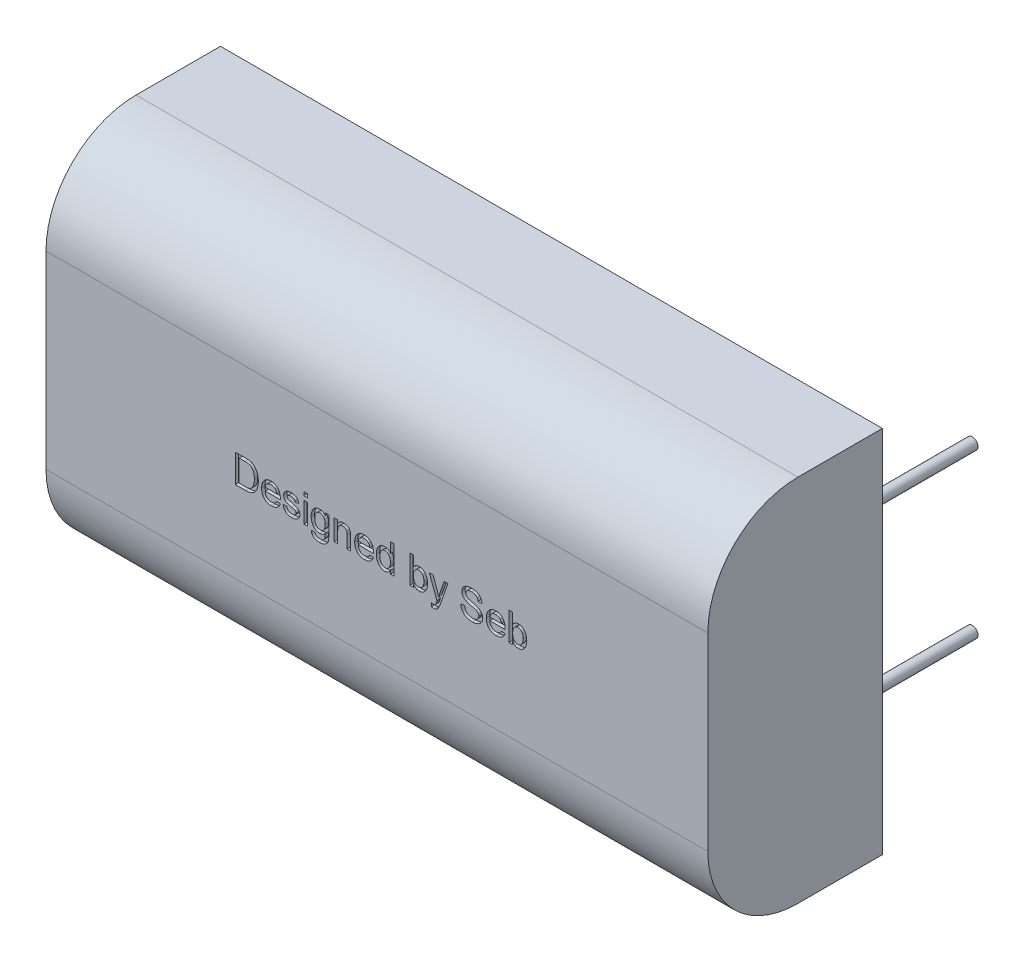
from build123d import *

# Parameters (mm, degrees)
SKETCH1_W           = 15.5
SKETCH1_H           = 32.8
BOSS_EXTRUDE1_DEPTH = 29.4
FILLET1_R           = 8
SKETCH2_R           = 0.5
BOSS_EXTRUDE2_DEPTH = 12
SKETCH3_W           = 0.32051282
SKETCH3_H           = 0.32051282
SKETCH3_H_2         = 1.826923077
CUT_EXTRUDE1_DEPTH  = 0.3


with BuildPart() as part:
    # Sketch1 → Boss-Extrude1 (new, symmetric)
    with BuildSketch(Plane(origin=(0, 0, 0), x_dir=(0, 0, -1), z_dir=(1, 0, 0))):
        Rectangle(SKETCH1_W, SKETCH1_H)
    extrude(amount=BOSS_EXTRUDE1_DEPTH, both=True)

    # Fillet1
    fillet1_edges = [part.edges().sort_by_distance(p)[0] for p in [
        (0, 16.4, 7.75),
        (0, -16.4, 7.75),
    ]]
    fillet(fillet1_edges, radius=FILLET1_R)

    # Sketch2 → Boss-Extrude2 (add)
    with BuildSketch(Plane(origin=(0, 0, -7.75), x_dir=(-1, 0, 0), z_dir=(0, 0, -1))):
        with Locations(Location((-25.4, 7.25, 0), (0, 0, 180))):
            Circle(SKETCH2_R)
        with Locations(Location((-25.4, -7.25, 0), (0, 0, 180))):
            Circle(SKETCH2_R)
    extrude(amount=BOSS_EXTRUDE2_DEPTH)

    # Sketch3 → Cut-Extrude1 (cut)
    # profile 1 of 14: a face of its own
    with BuildSketch(Plane.XY.offset(7.75)):
        with BuildLine():
            Line((-12.586012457, -1.161956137), (-12.586012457, 1.338043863))
            Line((-12.586012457, 1.338043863), (-11.731144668, 1.338043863))
            add(Edge.make_bspline(
                [(-11.731144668, 1.338043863), (-11.707773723, 1.337938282), (-11.662362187, 1.337733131), (-11.596397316, 1.336425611), (-11.534630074, 1.333271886), (-11.477345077, 1.329430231), (-11.424253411, 1.324315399), (-11.375422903, 1.318595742), (-11.330815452, 1.311135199), (-11.30277026, 1.304934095), (-11.289437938, 1.301986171)],
                knots=[0, 0, 0, 0, 1.263127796, 2.454354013, 3.565393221, 4.605443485, 5.557051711, 6.447822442, 7.26211484, 8, 8, 8, 8], degree=3))
            add(Edge.make_bspline(
                [(-11.289437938, 1.301986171), (-11.254958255, 1.292940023), (-11.18721955, 1.275167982), (-11.091599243, 1.235192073), (-11.003815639, 1.18504959), (-10.951754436, 1.143746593), (-10.925856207, 1.123200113)],
                knots=[0, 0, 0, 0, 1.04477941, 2.052571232, 3.03123721, 4, 4, 4, 4], degree=3))
            add(Edge.make_bspline(
                [(-10.925856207, 1.123200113), (-10.909776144, 1.109079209), (-10.877543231, 1.08077348), (-10.833271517, 1.034137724), (-10.792201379, 0.984664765), (-10.753106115, 0.933206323), (-10.718486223, 0.877886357), (-10.686034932, 0.820297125), (-10.657729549, 0.759282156), (-10.631674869, 0.695838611), (-10.608461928, 0.629719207), (-10.589388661, 0.560966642), (-10.571866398, 0.49029886), (-10.558833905, 0.416943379), (-10.547457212, 0.34152241), (-10.54023498, 0.263604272), (-10.535548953, 0.183421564), (-10.535005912, 0.129116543), (-10.534730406, 0.101565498)],
                knots=[0, 0, 0, 0, 0.908997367, 1.822109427, 2.728529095, 3.640759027, 4.565643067, 5.499218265, 6.448003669, 7.421473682, 8.413047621, 9.423472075, 10.452328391, 11.505545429, 12.587978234, 13.692612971, 14.829372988, 16, 16, 16, 16], degree=3))
            add(Edge.make_bspline(
                [(-10.534730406, 0.101565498), (-10.535401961, 0.055459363), (-10.536708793, -0.034262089), (-10.549632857, -0.164760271), (-10.56963175, -0.287424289), (-10.598737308, -0.401517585), (-10.634583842, -0.506407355), (-10.673689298, -0.60295026), (-10.718702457, -0.689482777), (-10.768080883, -0.766736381), (-10.820988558, -0.835199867), (-10.876415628, -0.895900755), (-10.934526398, -0.948865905), (-10.995025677, -0.995485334), (-11.061055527, -1.034087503), (-11.131923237, -1.068748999), (-11.209927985, -1.096599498), (-11.293600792, -1.120960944), (-11.383924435, -1.139211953), (-11.480409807, -1.152623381), (-11.583436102, -1.16073344), (-11.654173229, -1.161540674), (-11.690579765, -1.161956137)],
                knots=[0, 0, 0, 0, 1.410753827, 2.745293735, 4.009435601, 5.211453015, 6.344066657, 7.400119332, 8.396481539, 9.324811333, 10.202671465, 11.041621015, 11.837259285, 12.606727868, 13.374311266, 14.17412185, 15.017911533, 15.905707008, 16.839601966, 17.835295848, 18.885883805, 20, 20, 20, 20], degree=3))
            Line((-11.690579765, -1.161956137), (-12.586012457, -1.161956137))
        make_face()
        with BuildLine():
            Line((-12.233448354, -0.873494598), (-11.718123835, -0.873494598))
            add(Edge.make_bspline(
                [(-11.718123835, -0.873494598), (-11.680547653, -0.872932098), (-11.609461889, -0.871867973), (-11.5091711, -0.863695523), (-11.421640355, -0.849599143), (-11.34589903, -0.8295438), (-11.280181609, -0.803609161), (-11.222317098, -0.772948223), (-11.170845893, -0.738154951), (-11.141852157, -0.710318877), (-11.127679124, -0.696711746)],
                knots=[0, 0, 0, 0, 1.423649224, 2.693227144, 3.808972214, 4.778671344, 5.656058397, 6.479437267, 7.256702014, 8, 8, 8, 8], degree=3))
            add(Edge.make_bspline(
                [(-11.127679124, -0.696711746), (-11.109235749, -0.67562314), (-11.071346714, -0.632299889), (-11.024165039, -0.556616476), (-10.983020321, -0.471458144), (-10.948625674, -0.375918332), (-10.920422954, -0.27032019), (-10.901612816, -0.153717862), (-10.88931459, -0.02690419), (-10.887984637, 0.06130268), (-10.887294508, 0.107074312)],
                knots=[0, 0, 0, 0, 0.782184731, 1.606876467, 2.483531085, 3.422528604, 4.441347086, 5.534669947, 6.720709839, 8, 8, 8, 8], degree=3))
            add(Edge.make_bspline(
                [(-10.887294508, 0.107074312), (-10.887722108, 0.138963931), (-10.888553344, 0.200956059), (-10.893735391, 0.291268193), (-10.903965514, 0.375791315), (-10.917048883, 0.454671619), (-10.934912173, 0.527658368), (-10.955339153, 0.595450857), (-10.981036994, 0.65716287), (-11.010361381, 0.713270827), (-11.042530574, 0.764147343), (-11.076052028, 0.810885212), (-11.111097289, 0.853331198), (-11.14840894, 0.890881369), (-11.186865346, 0.924646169), (-11.227183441, 0.953934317), (-11.269250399, 0.978736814), (-11.298810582, 0.991611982), (-11.313476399, 0.997999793)],
                knots=[0, 0, 0, 0, 1.460126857, 2.838427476, 4.139102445, 5.35666337, 6.496721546, 7.577303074, 8.594995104, 9.55219858, 10.472533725, 11.348579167, 12.184287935, 12.989560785, 13.769667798, 14.524891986, 15.268148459, 16, 16, 16, 16], degree=3))
            add(Edge.make_bspline(
                [(-11.313476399, 0.997999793), (-11.324935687, 1.002193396), (-11.349217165, 1.011079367), (-11.388846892, 1.02113695), (-11.433074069, 1.030392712), (-11.482334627, 1.03688905), (-11.536379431, 1.043202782), (-11.595544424, 1.047039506), (-11.659519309, 1.048778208), (-11.703766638, 1.049308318), (-11.726637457, 1.049582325)],
                knots=[0, 0, 0, 0, 0.699400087, 1.48198292, 2.341906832, 3.289648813, 4.329964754, 5.462247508, 6.688271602, 8, 8, 8, 8], degree=3))
            Line((-11.726637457, 1.049582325), (-12.233448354, 1.049582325))
            Line((-12.233448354, 1.049582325), (-12.233448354, -0.873494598))
        make_face(mode=Mode.SUBTRACT)
    # profile 2 of 14: a face of its own
    with BuildSketch(Plane.XY.offset(7.75)):
        with BuildLine():
            Line((-8.90362063, -0.617084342), (-8.589618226, -0.649135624))
            add(Edge.make_bspline(
                [(-8.589618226, -0.649135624), (-8.59605652, -0.670315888), (-8.608721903, -0.71198161), (-8.634420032, -0.771076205), (-8.662658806, -0.827218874), (-8.696022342, -0.879186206), (-8.732630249, -0.928084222), (-8.773207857, -0.973522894), (-8.818642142, -1.014355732), (-8.867244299, -1.052287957), (-8.919823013, -1.085623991), (-8.975824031, -1.115055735), (-9.035452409, -1.139345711), (-9.098537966, -1.15958062), (-9.165224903, -1.175013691), (-9.2353895, -1.18567556), (-9.308939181, -1.193229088), (-9.359162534, -1.193743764), (-9.384890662, -1.194007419)],
                knots=[0, 0, 0, 0, 1.017198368, 2.001028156, 2.958938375, 3.904526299, 4.836491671, 5.766019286, 6.700699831, 7.641977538, 8.598163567, 9.559604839, 10.547559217, 11.555094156, 12.60347703, 13.691418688, 14.817373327, 16, 16, 16, 16], degree=3))
            add(Edge.make_bspline(
                [(-9.384890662, -1.194007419), (-9.417146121, -1.19324943), (-9.480034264, -1.191771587), (-9.571874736, -1.179915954), (-9.658625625, -1.161161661), (-9.740475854, -1.134590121), (-9.816900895, -1.09996254), (-9.888094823, -1.057374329), (-9.954500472, -1.007809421), (-10.015161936, -0.950394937), (-10.070046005, -0.886405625), (-10.116919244, -0.815255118), (-10.157571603, -0.738648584), (-10.189903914, -0.655341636), (-10.215459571, -0.566168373), (-10.233191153, -0.470749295), (-10.244535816, -0.369462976), (-10.245681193, -0.299775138), (-10.246268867, -0.264019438)],
                knots=[0, 0, 0, 0, 1.077616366, 2.10101772, 3.089143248, 4.040031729, 4.971276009, 5.886882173, 6.807369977, 7.734796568, 8.672701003, 9.618074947, 10.576315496, 11.565652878, 12.598619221, 13.67195277, 14.805516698, 16, 16, 16, 16], degree=3))
            add(Edge.make_bspline(
                [(-10.246268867, -0.264019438), (-10.245675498, -0.226931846), (-10.244523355, -0.154919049), (-10.233324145, -0.050068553), (-10.214802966, 0.048375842), (-10.189670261, 0.140771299), (-10.156367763, 0.226671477), (-10.115732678, 0.306045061), (-10.068016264, 0.379321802), (-10.012757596, 0.445428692), (-9.951613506, 0.504213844), (-9.886526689, 0.556486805), (-9.816131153, 0.599625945), (-9.741865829, 0.635443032), (-9.663014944, 0.662961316), (-9.580064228, 0.683227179), (-9.492382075, 0.69466265), (-9.432498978, 0.69622193), (-9.401917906, 0.697018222)],
                knots=[0, 0, 0, 0, 1.232307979, 2.392766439, 3.499416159, 4.558769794, 5.570548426, 6.555643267, 7.517416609, 8.470735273, 9.412423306, 10.33263532, 11.239503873, 12.150233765, 13.067967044, 14.009932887, 14.983713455, 16, 16, 16, 16], degree=3))
            add(Edge.make_bspline(
                [(-9.401917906, 0.697018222), (-9.372329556, 0.696257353), (-9.314424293, 0.69476831), (-9.229591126, 0.682817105), (-9.148755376, 0.66414133), (-9.072086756, 0.637015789), (-8.999971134, 0.601408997), (-8.931629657, 0.55891147), (-8.867539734, 0.508293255), (-8.808112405, 0.450244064), (-8.753965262, 0.385415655), (-8.707127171, 0.313556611), (-8.66746696, 0.235677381), (-8.635316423, 0.151182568), (-8.610568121, 0.060559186), (-8.592638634, -0.036252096), (-8.581331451, -0.139218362), (-8.580189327, -0.21006937), (-8.5796022, -0.246491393)],
                knots=[0, 0, 0, 0, 1.005323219, 1.967446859, 2.906060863, 3.821317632, 4.724696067, 5.63467896, 6.55185077, 7.494776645, 8.453732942, 9.416859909, 10.403972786, 11.418730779, 12.484189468, 13.592581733, 14.76243057, 16, 16, 16, 16], degree=3))
            add(Edge.make_bspline(
                [(-8.5796022, -0.246491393), (-8.57975472, -0.257843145), (-8.580122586, -0.285222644), (-8.580742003, -0.312597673), (-8.581104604, -0.328622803)],
                knots=[0, 0, 0, 0, 0.829215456, 2, 2, 2, 2], degree=3))
            Line((-8.581104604, -0.328622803), (-9.925756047, -0.328622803))
            add(Edge.make_bspline(
                [(-9.925756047, -0.328622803), (-9.923900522, -0.351195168), (-9.920270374, -0.395355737), (-9.909684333, -0.459292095), (-9.895398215, -0.519379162), (-9.876167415, -0.575087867), (-9.853449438, -0.62704213), (-9.825373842, -0.674387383), (-9.79409524, -0.718175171), (-9.758156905, -0.757337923), (-9.719372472, -0.792172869), (-9.677868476, -0.822730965), (-9.63371852, -0.848076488), (-9.587561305, -0.869383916), (-9.538965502, -0.885417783), (-9.488152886, -0.896892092), (-9.434839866, -0.904070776), (-9.398435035, -0.905047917), (-9.379882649, -0.90554588)],
                knots=[0, 0, 0, 0, 1.224729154, 2.396059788, 3.502114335, 4.561587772, 5.580251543, 6.563724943, 7.533714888, 8.486186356, 9.43260269, 10.350144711, 11.268619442, 12.181885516, 13.095687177, 14.031096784, 14.996620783, 16, 16, 16, 16], degree=3))
            add(Edge.make_bspline(
                [(-9.379882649, -0.90554588), (-9.35279485, -0.904638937), (-9.300318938, -0.902881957), (-9.224600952, -0.890555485), (-9.155193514, -0.868821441), (-9.091608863, -0.838651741), (-9.03395251, -0.798659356), (-8.983642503, -0.747469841), (-8.938913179, -0.686801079), (-8.915648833, -0.640844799), (-8.90362063, -0.617084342)],
                knots=[0, 0, 0, 0, 1.096312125, 2.123833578, 3.094060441, 4.030938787, 4.962563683, 5.918139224, 6.923629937, 8, 8, 8, 8], degree=3))
        make_face()
        with BuildLine():
            Line((-9.925756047, -0.040161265), (-8.900115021, -0.040161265))
            add(Edge.make_bspline(
                [(-8.900115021, -0.040161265), (-8.902132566, -0.024280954), (-8.906077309, 0.006768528), (-8.914380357, 0.051677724), (-8.925453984, 0.093519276), (-8.938790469, 0.132136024), (-8.955053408, 0.167601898), (-8.973427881, 0.199971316), (-8.993959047, 0.229589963), (-9.009915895, 0.24680309), (-9.017803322, 0.255311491)],
                knots=[0, 0, 0, 0, 1.185316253, 2.317552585, 3.379013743, 4.387694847, 5.339152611, 6.263729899, 7.141766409, 8, 8, 8, 8], degree=3))
            add(Edge.make_bspline(
                [(-9.017803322, 0.255311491), (-9.030405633, 0.267611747), (-9.05529735, 0.291906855), (-9.096798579, 0.323224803), (-9.141400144, 0.349196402), (-9.188234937, 0.371605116), (-9.238350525, 0.387839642), (-9.290743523, 0.400103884), (-9.346143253, 0.407051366), (-9.384037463, 0.408047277), (-9.403420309, 0.408556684)],
                knots=[0, 0, 0, 0, 0.989486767, 1.954405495, 2.91383024, 3.888017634, 4.867526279, 5.869356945, 6.910178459, 8, 8, 8, 8], degree=3))
            add(Edge.make_bspline(
                [(-9.403420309, 0.408556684), (-9.420963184, 0.408149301), (-9.455302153, 0.407351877), (-9.50589101, 0.401740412), (-9.554377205, 0.392438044), (-9.60067479, 0.378636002), (-9.644952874, 0.361861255), (-9.686900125, 0.340417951), (-9.726810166, 0.315501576), (-9.764524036, 0.287000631), (-9.798641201, 0.255060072), (-9.829841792, 0.221036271), (-9.855672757, 0.183432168), (-9.878575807, 0.143999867), (-9.89650905, 0.10150874), (-9.910626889, 0.056584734), (-9.920676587, 0.009104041), (-9.924047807, -0.023593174), (-9.925756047, -0.040161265)],
                knots=[0, 0, 0, 0, 1.10270868, 2.158476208, 3.195774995, 4.201977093, 5.192014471, 6.168217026, 7.158254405, 8.146844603, 9.134487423, 10.093158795, 11.042305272, 11.996428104, 12.955501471, 13.934632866, 14.95345241, 16, 16, 16, 16], degree=3))
        make_face(mode=Mode.SUBTRACT)
    # profile 3 of 14: a face of its own
    with BuildSketch(Plane.XY.offset(7.75)):
        with BuildLine():
            Line((-8.323191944, -0.58503306), (-8.002679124, -0.552981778))
            add(Edge.make_bspline(
                [(-8.002679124, -0.552981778), (-7.997783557, -0.58010601), (-7.988407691, -0.632053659), (-7.959611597, -0.70364509), (-7.920759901, -0.765562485), (-7.878911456, -0.808694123), (-7.839991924, -0.836482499), (-7.80833894, -0.855351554), (-7.773543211, -0.870589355), (-7.736455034, -0.883772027), (-7.696544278, -0.893761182), (-7.653828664, -0.90070218), (-7.608287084, -0.904594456), (-7.577005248, -0.905223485), (-7.560972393, -0.90554588)],
                knots=[0, 0, 0, 0, 1.576426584, 3.019132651, 4.39139761, 5.744583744, 6.429748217, 7.128801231, 7.852561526, 8.603024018, 9.382742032, 10.206978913, 11.081024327, 12, 12, 12, 12], degree=3))
            add(Edge.make_bspline(
                [(-7.560972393, -0.90554588), (-7.544935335, -0.905462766), (-7.513807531, -0.905301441), (-7.468860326, -0.900958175), (-7.426999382, -0.895184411), (-7.388416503, -0.886838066), (-7.353192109, -0.875602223), (-7.320697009, -0.862869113), (-7.291771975, -0.846767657), (-7.258238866, -0.823145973), (-7.223664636, -0.789691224), (-7.192097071, -0.74531526), (-7.172704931, -0.696533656), (-7.17046938, -0.662656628), (-7.16934579, -0.645630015)],
                knots=[0, 0, 0, 0, 1.101207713, 2.137435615, 3.099211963, 4.003546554, 4.845050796, 5.637285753, 6.396976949, 7.112904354, 8.451176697, 9.67915534, 10.8335422, 12, 12, 12, 12], degree=3))
            add(Edge.make_bspline(
                [(-7.16934579, -0.645630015), (-7.16952671, -0.637909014), (-7.169881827, -0.622753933), (-7.175880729, -0.60103865), (-7.184403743, -0.580514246), (-7.196702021, -0.561309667), (-7.212282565, -0.543349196), (-7.231271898, -0.526487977), (-7.253707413, -0.511126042), (-7.270408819, -0.502395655), (-7.279021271, -0.497893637)],
                knots=[0, 0, 0, 0, 0.948511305, 1.861774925, 2.756066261, 3.680846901, 4.658374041, 5.678500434, 6.80286706, 8, 8, 8, 8], degree=3))
            add(Edge.make_bspline(
                [(-7.279021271, -0.497893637), (-7.286165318, -0.494639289), (-7.301775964, -0.487528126), (-7.328037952, -0.477858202), (-7.35851111, -0.466439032), (-7.394049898, -0.456015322), (-7.433865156, -0.44374757), (-7.478301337, -0.430539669), (-7.527771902, -0.418002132), (-7.562148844, -0.408946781), (-7.580002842, -0.404243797)],
                knots=[0, 0, 0, 0, 0.596822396, 1.30413245, 2.127382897, 3.071041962, 4.119245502, 5.296370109, 6.595843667, 8, 8, 8, 8], degree=3))
            add(Edge.make_bspline(
                [(-7.580002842, -0.404243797), (-7.604387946, -0.3971088), (-7.651377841, -0.383359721), (-7.718988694, -0.362823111), (-7.781454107, -0.343217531), (-7.838814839, -0.324455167), (-7.890805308, -0.305801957), (-7.937684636, -0.288427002), (-7.979134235, -0.271244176), (-8.027211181, -0.250730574), (-8.080115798, -0.22186774), (-8.136081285, -0.181141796), (-8.183442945, -0.133609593), (-8.222732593, -0.080801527), (-8.253573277, -0.023436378), (-8.274921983, 0.037620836), (-8.288570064, 0.101466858), (-8.290275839, 0.145065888), (-8.291140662, 0.167170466)],
                knots=[0, 0, 0, 0, 1.22605552, 2.362598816, 3.409724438, 4.385374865, 5.274589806, 6.075051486, 6.797583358, 7.439654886, 8.596878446, 9.697305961, 10.768176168, 11.821850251, 12.863383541, 13.897821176, 14.934201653, 16, 16, 16, 16], degree=3))
            add(Edge.make_bspline(
                [(-8.291140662, 0.167170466), (-8.290447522, 0.187245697), (-8.289075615, 0.22697989), (-8.278729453, 0.285299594), (-8.262253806, 0.341563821), (-8.238464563, 0.39501461), (-8.209322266, 0.445451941), (-8.174115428, 0.491156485), (-8.135390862, 0.533467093), (-8.105362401, 0.557016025), (-8.090319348, 0.568813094)],
                knots=[0, 0, 0, 0, 1.034021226, 2.046601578, 3.042752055, 4.048071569, 5.054273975, 6.036661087, 7.016446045, 8, 8, 8, 8], degree=3))
            add(Edge.make_bspline(
                [(-8.090319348, 0.568813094), (-8.077781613, 0.577560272), (-8.051512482, 0.595887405), (-8.007115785, 0.619868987), (-7.956165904, 0.641191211), (-7.899750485, 0.660294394), (-7.839210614, 0.677104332), (-7.775630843, 0.688197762), (-7.710049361, 0.695560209), (-7.665660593, 0.696526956), (-7.643103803, 0.697018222)],
                knots=[0, 0, 0, 0, 0.776203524, 1.626305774, 2.557252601, 3.57906176, 4.650888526, 5.745456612, 6.854321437, 8, 8, 8, 8], degree=3))
            add(Edge.make_bspline(
                [(-7.643103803, 0.697018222), (-7.609518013, 0.696246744), (-7.544309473, 0.694748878), (-7.449695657, 0.68325732), (-7.3614973, 0.663694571), (-7.280182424, 0.63702761), (-7.207053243, 0.603685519), (-7.143000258, 0.564868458), (-7.089810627, 0.519302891), (-7.045937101, 0.467967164), (-7.010758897, 0.409072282), (-6.982604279, 0.342035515), (-6.959967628, 0.266259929), (-6.950128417, 0.212362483), (-6.944986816, 0.184197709)],
                knots=[0, 0, 0, 0, 1.253394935, 2.433530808, 3.550681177, 4.620594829, 5.621516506, 6.544862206, 7.406547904, 8.22431151, 9.054607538, 9.956211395, 10.931993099, 12, 12, 12, 12], degree=3))
            Line((-6.944986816, 0.184197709), (-7.265499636, 0.152146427))
            add(Edge.make_bspline(
                [(-7.265499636, 0.152146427), (-7.269312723, 0.171369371), (-7.276711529, 0.208669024), (-7.299112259, 0.260301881), (-7.330921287, 0.304750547), (-7.371317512, 0.342480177), (-7.420461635, 0.372978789), (-7.479203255, 0.393644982), (-7.546356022, 0.406895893), (-7.594288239, 0.407983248), (-7.619566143, 0.408556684)],
                knots=[0, 0, 0, 0, 0.971549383, 1.88516682, 2.771115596, 3.668786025, 4.614654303, 5.622170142, 6.746009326, 8, 8, 8, 8], degree=3))
            add(Edge.make_bspline(
                [(-7.619566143, 0.408556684), (-7.634761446, 0.408375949), (-7.664015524, 0.408027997), (-7.706327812, 0.405057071), (-7.745226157, 0.399923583), (-7.781051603, 0.393904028), (-7.813050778, 0.384588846), (-7.842151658, 0.374360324), (-7.867543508, 0.361263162), (-7.89634125, 0.342502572), (-7.92499528, 0.315339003), (-7.951773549, 0.280063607), (-7.967745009, 0.24070372), (-7.969667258, 0.213377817), (-7.970627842, 0.199722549)],
                knots=[0, 0, 0, 0, 1.202032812, 2.314159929, 3.352655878, 4.305866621, 5.183839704, 5.986040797, 6.742017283, 7.437935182, 8.699432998, 9.843179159, 10.922196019, 12, 12, 12, 12], degree=3))
            add(Edge.make_bspline(
                [(-7.970627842, 0.199722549), (-7.970305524, 0.190994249), (-7.969669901, 0.173781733), (-7.962710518, 0.148937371), (-7.95214452, 0.125370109), (-7.942166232, 0.111266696), (-7.937074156, 0.104069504)],
                knots=[0, 0, 0, 0, 1.012137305, 1.99597066, 2.977312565, 4, 4, 4, 4], degree=3))
            add(Edge.make_bspline(
                [(-7.937074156, 0.104069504), (-7.930968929, 0.096814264), (-7.918264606, 0.081716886), (-7.893384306, 0.062933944), (-7.864433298, 0.045283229), (-7.842725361, 0.035864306), (-7.831405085, 0.030952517)],
                knots=[0, 0, 0, 0, 0.873299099, 1.81724178, 2.861733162, 4, 4, 4, 4], degree=3))
            add(Edge.make_bspline(
                [(-7.831405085, 0.030952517), (-7.827073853, 0.029422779), (-7.816967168, 0.025853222), (-7.799032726, 0.020391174), (-7.776374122, 0.013400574), (-7.748439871, 0.005407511), (-7.715766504, -0.004099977), (-7.677820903, -0.014602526), (-7.63513014, -0.026614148), (-7.604882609, -0.034843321), (-7.589017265, -0.039159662)],
                knots=[0, 0, 0, 0, 0.436802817, 1.019254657, 1.782618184, 2.69198815, 3.782349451, 5.018834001, 6.436327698, 8, 8, 8, 8], degree=3))
            add(Edge.make_bspline(
                [(-7.589017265, -0.039159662), (-7.565465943, -0.046293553), (-7.519984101, -0.06007038), (-7.454108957, -0.080811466), (-7.392778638, -0.100138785), (-7.336170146, -0.118627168), (-7.284321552, -0.136360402), (-7.236983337, -0.152619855), (-7.194294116, -0.168292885), (-7.144221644, -0.187055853), (-7.087334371, -0.212338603), (-7.02697717, -0.250675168), (-6.974070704, -0.295187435), (-6.929176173, -0.345911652), (-6.89269817, -0.403271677), (-6.867431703, -0.46770865), (-6.851267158, -0.538334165), (-6.849662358, -0.587610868), (-6.84883297, -0.613077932)],
                knots=[0, 0, 0, 0, 1.155996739, 2.232437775, 3.244329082, 4.176768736, 5.029854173, 5.818511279, 6.528027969, 7.165934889, 8.330913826, 9.444808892, 10.513164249, 11.568838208, 12.615385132, 13.688622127, 14.805439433, 16, 16, 16, 16], degree=3))
            add(Edge.make_bspline(
                [(-6.84883297, -0.613077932), (-6.849871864, -0.638712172), (-6.85194434, -0.689849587), (-6.869362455, -0.765012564), (-6.896531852, -0.83815543), (-6.9350979, -0.90775972), (-6.983626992, -0.972824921), (-7.042885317, -1.030280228), (-7.112007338, -1.079829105), (-7.190054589, -1.120760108), (-7.275243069, -1.154240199), (-7.366965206, -1.176408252), (-7.463791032, -1.191953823), (-7.530357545, -1.193311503), (-7.564478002, -1.194007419)],
                knots=[0, 0, 0, 0, 0.894809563, 1.785044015, 2.682170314, 3.614214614, 4.555721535, 5.508634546, 6.486485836, 7.51727745, 8.581064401, 9.676123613, 10.808834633, 12, 12, 12, 12], degree=3))
            add(Edge.make_bspline(
                [(-7.564478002, -1.194007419), (-7.592537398, -1.1935129), (-7.646911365, -1.192554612), (-7.72591291, -1.185573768), (-7.799778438, -1.173718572), (-7.868455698, -1.156759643), (-7.931982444, -1.135190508), (-7.990539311, -1.109229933), (-8.043998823, -1.078052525), (-8.092332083, -1.041840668), (-8.135853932, -1.000569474), (-8.175457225, -0.955084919), (-8.210695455, -0.904713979), (-8.241121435, -0.849580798), (-8.2684016, -0.790268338), (-8.291313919, -0.726096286), (-8.30988986, -0.657226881), (-8.318687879, -0.609477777), (-8.323191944, -0.58503306)],
                knots=[0, 0, 0, 0, 1.244406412, 2.411431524, 3.514215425, 4.559320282, 5.545040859, 6.48623969, 7.395443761, 8.283912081, 9.158607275, 10.050831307, 10.954592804, 11.879399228, 12.840196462, 13.8472361, 14.897912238, 16, 16, 16, 16], degree=3))
        make_face()
    # profile 4 of 14: a face of its own
    with BuildSketch(Plane.XY.offset(7.75)):
        with Locations((-6.336012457, 1.177787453)):
            Rectangle(SKETCH3_W, SKETCH3_H)
    # profile 5 of 14: a face of its own
    with BuildSketch(Plane.XY.offset(7.75)):
        with Locations((-6.336012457, -0.248494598)):
            Rectangle(SKETCH3_W, SKETCH3_H_2)
    # profile 6 of 14: a face of its own
    with BuildSketch(Plane.XY.offset(7.75)):
        with BuildLine():
            Line((-5.811172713, -1.290161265), (-5.490659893, -1.322212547))
            add(Edge.make_bspline(
                [(-5.490659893, -1.322212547), (-5.487121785, -1.341650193), (-5.480372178, -1.378731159), (-5.457939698, -1.428576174), (-5.429118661, -1.471668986), (-5.402652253, -1.492264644), (-5.389498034, -1.502501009)],
                knots=[0, 0, 0, 0, 1.110696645, 2.118862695, 3.065045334, 4, 4, 4, 4], degree=3))
            add(Edge.make_bspline(
                [(-5.389498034, -1.502501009), (-5.369652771, -1.514259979), (-5.32836162, -1.538726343), (-5.256329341, -1.562020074), (-5.174702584, -1.575920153), (-5.116959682, -1.577689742), (-5.086513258, -1.578622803)],
                knots=[0, 0, 0, 0, 0.871695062, 1.813696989, 2.847215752, 4, 4, 4, 4], degree=3))
            add(Edge.make_bspline(
                [(-5.086513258, -1.578622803), (-5.069806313, -1.578553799), (-5.037174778, -1.578419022), (-4.989955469, -1.573815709), (-4.945318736, -1.568953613), (-4.903962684, -1.560040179), (-4.865011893, -1.550058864), (-4.829690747, -1.536044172), (-4.796528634, -1.521465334), (-4.757649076, -1.497277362), (-4.714367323, -1.461966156), (-4.670538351, -1.412064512), (-4.636850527, -1.353651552), (-4.622235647, -1.310987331), (-4.61475845, -1.289159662)],
                knots=[0, 0, 0, 0, 1.001026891, 1.95517755, 2.8427591, 3.690690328, 4.48947297, 5.249706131, 5.966189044, 6.657918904, 7.988115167, 9.300572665, 10.618931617, 12, 12, 12, 12], degree=3))
            add(Edge.make_bspline(
                [(-4.61475845, -1.289159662), (-4.612791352, -1.281172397), (-4.608440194, -1.263504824), (-4.604437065, -1.233791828), (-4.600201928, -1.198598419), (-4.597553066, -1.157466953), (-4.59490208, -1.110569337), (-4.593507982, -1.057964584), (-4.593141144, -0.999697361), (-4.593195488, -0.958964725), (-4.593223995, -0.937597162)],
                knots=[0, 0, 0, 0, 0.558973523, 1.23643144, 2.036175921, 2.969448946, 4.037954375, 5.230299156, 6.547067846, 8, 8, 8, 8], degree=3))
            add(Edge.make_bspline(
                [(-4.593223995, -0.937597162), (-4.609718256, -0.955499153), (-4.642114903, -0.990660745), (-4.696147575, -1.036139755), (-4.752571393, -1.075387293), (-4.812501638, -1.10697238), (-4.875485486, -1.131715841), (-4.941519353, -1.149188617), (-5.010533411, -1.160031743), (-5.057593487, -1.161307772), (-5.081505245, -1.161956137)],
                knots=[0, 0, 0, 0, 1.051596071, 2.065457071, 3.046490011, 4.018372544, 4.987463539, 5.966183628, 6.966594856, 8, 8, 8, 8], degree=3))
            add(Edge.make_bspline(
                [(-5.081505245, -1.161956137), (-5.110942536, -1.161326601), (-5.168454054, -1.16009668), (-5.252000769, -1.146411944), (-5.330657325, -1.125835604), (-5.404078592, -1.095795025), (-5.47258574, -1.057768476), (-5.535509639, -1.010717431), (-5.593323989, -0.955365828), (-5.645133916, -0.892082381), (-5.691423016, -0.823048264), (-5.732074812, -0.750174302), (-5.767053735, -0.674008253), (-5.794069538, -0.593886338), (-5.816636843, -0.511056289), (-5.831738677, -0.424544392), (-5.84170724, -0.334867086), (-5.842713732, -0.273896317), (-5.843223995, -0.242985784)],
                knots=[0, 0, 0, 0, 1.053905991, 2.05901193, 3.025421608, 3.961855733, 4.893808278, 5.825799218, 6.769295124, 7.755025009, 8.750490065, 9.744030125, 10.742581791, 11.74900413, 12.770513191, 13.815982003, 14.892761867, 16, 16, 16, 16], degree=3))
            add(Edge.make_bspline(
                [(-5.843223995, -0.242985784), (-5.842260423, -0.200354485), (-5.840363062, -0.116409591), (-5.82255191, 0.006597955), (-5.795331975, 0.124822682), (-5.762630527, 0.218909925), (-5.731411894, 0.290505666), (-5.705338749, 0.340993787), (-5.676116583, 0.387901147), (-5.645103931, 0.432247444), (-5.611611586, 0.473403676), (-5.57530662, 0.511117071), (-5.536633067, 0.54575309), (-5.495608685, 0.577475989), (-5.452017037, 0.605249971), (-5.406883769, 0.63016908), (-5.359481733, 0.650571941), (-5.310505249, 0.66773724), (-5.259519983, 0.680653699), (-5.20684347, 0.690303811), (-5.152232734, 0.69574888), (-5.115237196, 0.696591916), (-5.096529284, 0.697018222)],
                knots=[0, 0, 0, 0, 1.897475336, 3.736300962, 5.523301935, 7.293648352, 8.162460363, 9.000380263, 9.82151075, 10.621780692, 11.408995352, 12.181898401, 12.950535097, 13.719279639, 14.488455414, 15.250267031, 16.0126588, 16.783807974, 17.559138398, 18.352402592, 19.166842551, 20, 20, 20, 20], degree=3))
            add(Edge.make_bspline(
                [(-5.096529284, 0.697018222), (-5.071607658, 0.696267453), (-5.022468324, 0.694787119), (-4.950648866, 0.682515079), (-4.882215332, 0.662346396), (-4.817183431, 0.634002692), (-4.755274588, 0.597955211), (-4.697369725, 0.553074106), (-4.642273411, 0.501004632), (-4.609813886, 0.461035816), (-4.593223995, 0.440607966)],
                knots=[0, 0, 0, 0, 1.01929062, 2.009791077, 2.971609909, 3.932263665, 4.905848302, 5.895028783, 6.924160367, 8, 8, 8, 8], degree=3))
            Line((-4.593223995, 0.440607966), (-4.593223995, 0.66496694))
            Line((-4.593223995, 0.66496694), (-4.272711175, 0.66496694))
            Line((-4.272711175, 0.66496694), (-4.272711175, -0.892024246))
            add(Edge.make_bspline(
                [(-4.272711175, -0.892024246), (-4.273012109, -0.925749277), (-4.273591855, -0.990720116), (-4.277640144, -1.084415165), (-4.283892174, -1.170641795), (-4.293115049, -1.249246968), (-4.305853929, -1.32002794), (-4.319943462, -1.383424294), (-4.337097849, -1.439241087), (-4.358219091, -1.487765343), (-4.381782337, -1.531441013), (-4.408410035, -1.571731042), (-4.437425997, -1.610271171), (-4.470348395, -1.645905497), (-4.50630284, -1.679443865), (-4.545670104, -1.710488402), (-4.587689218, -1.739654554), (-4.632946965, -1.766133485), (-4.680799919, -1.790279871), (-4.731805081, -1.810753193), (-4.785290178, -1.82835204), (-4.841751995, -1.842260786), (-4.900787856, -1.853235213), (-4.962483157, -1.861122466), (-5.02682563, -1.866412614), (-5.070643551, -1.866857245), (-5.093023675, -1.867084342)],
                knots=[0, 0, 0, 0, 1.64197855, 3.163250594, 4.565204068, 5.850564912, 7.014446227, 8.065312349, 9.01127449, 9.852247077, 10.63778093, 11.424533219, 12.201569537, 12.983943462, 13.783315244, 14.593155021, 15.422818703, 16.271726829, 17.144084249, 18.030041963, 18.945050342, 19.883369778, 20.85896591, 21.867096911, 22.910613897, 24, 24, 24, 24], degree=3))
            add(Edge.make_bspline(
                [(-5.093023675, -1.867084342), (-5.119419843, -1.866818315), (-5.171142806, -1.86629704), (-5.246680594, -1.858743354), (-5.318470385, -1.848407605), (-5.386077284, -1.831797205), (-5.450064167, -1.812241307), (-5.510235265, -1.787696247), (-5.565853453, -1.757696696), (-5.618070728, -1.724700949), (-5.665082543, -1.686474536), (-5.705763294, -1.643435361), (-5.739862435, -1.595513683), (-5.767374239, -1.543278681), (-5.788699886, -1.486432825), (-5.80295609, -1.424996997), (-5.811154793, -1.358998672), (-5.811166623, -1.313555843), (-5.811172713, -1.290161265)],
                knots=[0, 0, 0, 0, 1.208388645, 2.367822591, 3.474003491, 4.527319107, 5.552625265, 6.53656117, 7.497656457, 8.443516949, 9.36178258, 10.265029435, 11.147589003, 12.047074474, 12.961608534, 13.920359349, 14.929373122, 16, 16, 16, 16], degree=3))
        make_face()
        with BuildLine():
            add(Edge.make_bspline(
                [(-5.522711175, -0.220950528), (-5.522419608, -0.248345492), (-5.521855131, -0.301382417), (-5.514911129, -0.377910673), (-5.505516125, -0.448824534), (-5.490784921, -0.513737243), (-5.472597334, -0.573274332), (-5.449433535, -0.626820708), (-5.422996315, -0.675227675), (-5.39172169, -0.7172708), (-5.357497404, -0.753905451), (-5.321129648, -0.785850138), (-5.282569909, -0.813009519), (-5.241853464, -0.835061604), (-5.199262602, -0.852506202), (-5.154283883, -0.864275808), (-5.107319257, -0.872119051), (-5.07519387, -0.87303301), (-5.058969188, -0.873494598)],
                knots=[0, 0, 0, 0, 1.45632428, 2.819458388, 4.083699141, 5.257462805, 6.355283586, 7.389222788, 8.354942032, 9.281768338, 10.167418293, 11.01672946, 11.851628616, 12.669938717, 13.474408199, 14.2927183, 15.137750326, 16, 16, 16, 16], degree=3))
            add(Edge.make_bspline(
                [(-5.058969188, -0.873494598), (-5.042757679, -0.872965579), (-5.010848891, -0.871924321), (-4.963996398, -0.865132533), (-4.919497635, -0.852131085), (-4.876806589, -0.835184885), (-4.83590604, -0.813501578), (-4.797151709, -0.786902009), (-4.760935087, -0.75474376), (-4.726346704, -0.71837275), (-4.694481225, -0.676770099), (-4.66736939, -0.628989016), (-4.64461987, -0.575805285), (-4.625408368, -0.517381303), (-4.611186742, -0.453430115), (-4.60083288, -0.384150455), (-4.594133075, -0.309389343), (-4.593533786, -0.257691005), (-4.593223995, -0.230966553)],
                knots=[0, 0, 0, 0, 0.870520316, 1.713427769, 2.533340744, 3.35384133, 4.175760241, 5.013553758, 5.871011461, 6.771289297, 7.705201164, 8.676799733, 9.712428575, 10.806445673, 11.973986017, 13.225054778, 14.565545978, 16, 16, 16, 16], degree=3))
            add(Edge.make_bspline(
                [(-4.593223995, -0.230966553), (-4.593544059, -0.205244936), (-4.594162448, -0.155548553), (-4.600732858, -0.083404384), (-4.611817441, -0.016178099), (-4.626361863, 0.046485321), (-4.646226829, 0.104017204), (-4.66950721, 0.156935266), (-4.697653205, 0.204907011), (-4.730316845, 0.247464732), (-4.766100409, 0.284789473), (-4.802849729, 0.318209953), (-4.842028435, 0.345921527), (-4.882525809, 0.369366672), (-4.92542625, 0.386785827), (-4.969905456, 0.39944774), (-5.016133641, 0.407144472), (-5.04758878, 0.408082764), (-5.063476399, 0.408556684)],
                knots=[0, 0, 0, 0, 1.387266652, 2.680318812, 3.903168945, 5.060782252, 6.145785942, 7.181734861, 8.174799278, 9.138396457, 10.068419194, 10.961341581, 11.813462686, 12.65229968, 13.480091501, 14.303906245, 15.143323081, 16, 16, 16, 16], degree=3))
            add(Edge.make_bspline(
                [(-5.063476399, 0.408556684), (-5.079197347, 0.408088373), (-5.110156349, 0.407166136), (-5.155569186, 0.399476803), (-5.198938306, 0.386688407), (-5.241037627, 0.369790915), (-5.280898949, 0.346913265), (-5.31955241, 0.319859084), (-5.35533741, 0.286759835), (-5.390125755, 0.24994563), (-5.421851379, 0.207900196), (-5.448687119, 0.160384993), (-5.471900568, 0.108648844), (-5.490383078, 0.0518625), (-5.50470183, -0.009656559), (-5.515044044, -0.075941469), (-5.521804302, -0.146859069), (-5.522402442, -0.1957271), (-5.522711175, -0.220950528)],
                knots=[0, 0, 0, 0, 0.863270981, 1.700025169, 2.521359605, 3.3439219, 4.185686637, 5.040685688, 5.930250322, 6.858130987, 7.821061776, 8.815234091, 9.849744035, 10.93146729, 12.09040003, 13.316165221, 14.614728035, 16, 16, 16, 16], degree=3))
        make_face(mode=Mode.SUBTRACT)
    # profile 7 of 14: a face of its own
    with BuildSketch(Plane.XY.offset(7.75)):
        with BuildLine():
            Line((-3.803961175, -1.161956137), (-3.803961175, 0.66496694))
            Line((-3.803961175, 0.66496694), (-3.483448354, 0.66496694))
            Line((-3.483448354, 0.66496694), (-3.483448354, 0.410059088))
            add(Edge.make_bspline(
                [(-3.483448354, 0.410059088), (-3.466923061, 0.43282696), (-3.434504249, 0.477492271), (-3.378098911, 0.5366244), (-3.315770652, 0.585930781), (-3.248833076, 0.627254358), (-3.175738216, 0.658206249), (-3.097609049, 0.680835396), (-3.01401176, 0.694575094), (-2.956490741, 0.696191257), (-2.92705813, 0.697018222)],
                knots=[0, 0, 0, 0, 1.031609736, 2.02378021, 2.987167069, 3.941100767, 4.901503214, 5.890206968, 6.920451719, 8, 8, 8, 8], degree=3))
            add(Edge.make_bspline(
                [(-2.92705813, 0.697018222), (-2.901312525, 0.69638863), (-2.850413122, 0.695143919), (-2.775823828, 0.683961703), (-2.704343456, 0.665215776), (-2.636938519, 0.639594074), (-2.575396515, 0.607610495), (-2.52023079, 0.572063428), (-2.47491711, 0.529794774), (-2.437140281, 0.483503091), (-2.40654921, 0.432598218), (-2.380955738, 0.377695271), (-2.360179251, 0.318306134), (-2.350882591, 0.27662539), (-2.346128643, 0.255311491)],
                knots=[0, 0, 0, 0, 1.157394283, 2.288183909, 3.382623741, 4.475775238, 5.523428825, 6.497939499, 7.417115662, 8.297706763, 9.177144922, 10.080641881, 11.018515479, 12, 12, 12, 12], degree=3))
            add(Edge.make_bspline(
                [(-2.346128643, 0.255311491), (-2.344684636, 0.247481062), (-2.341595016, 0.230726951), (-2.339004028, 0.20323475), (-2.335842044, 0.171884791), (-2.333258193, 0.136321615), (-2.33218595, 0.096888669), (-2.330239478, 0.053504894), (-2.330178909, 0.006077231), (-2.329799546, -0.02697428), (-2.3296022, -0.044167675)],
                knots=[0, 0, 0, 0, 0.636116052, 1.361043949, 2.205423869, 3.155086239, 4.209902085, 5.358053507, 6.625659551, 8, 8, 8, 8], degree=3))
            Line((-2.3296022, -0.044167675), (-2.3296022, -1.161956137))
            Line((-2.3296022, -1.161956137), (-2.650115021, -1.161956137))
            Line((-2.650115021, -1.161956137), (-2.650115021, -0.071210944))
            add(Edge.make_bspline(
                [(-2.650115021, -0.071210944), (-2.650397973, -0.04215008), (-2.650925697, 0.012050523), (-2.657272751, 0.08756263), (-2.667737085, 0.151579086), (-2.683217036, 0.205241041), (-2.704350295, 0.250949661), (-2.732443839, 0.290353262), (-2.76685503, 0.325517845), (-2.808181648, 0.354684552), (-2.854263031, 0.378803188), (-2.904776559, 0.396591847), (-2.959390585, 0.40648895), (-2.996964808, 0.407856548), (-3.016200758, 0.408556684)],
                knots=[0, 0, 0, 0, 1.506563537, 2.809849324, 3.925549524, 4.864928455, 5.69744782, 6.523597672, 7.362170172, 8.236610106, 9.134847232, 10.051947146, 11.002703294, 12, 12, 12, 12], degree=3))
            add(Edge.make_bspline(
                [(-3.016200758, 0.408556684), (-3.031902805, 0.408122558), (-3.062736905, 0.407270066), (-3.108293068, 0.401997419), (-3.151784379, 0.391415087), (-3.19424016, 0.379002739), (-3.234342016, 0.360904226), (-3.273237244, 0.339973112), (-3.310356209, 0.314655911), (-3.346116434, 0.28578603), (-3.379628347, 0.251501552), (-3.407396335, 0.209296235), (-3.430843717, 0.160678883), (-3.450573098, 0.105506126), (-3.46509501, 0.043124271), (-3.476042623, -0.025982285), (-3.482529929, -0.10197016), (-3.483133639, -0.154831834), (-3.483448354, -0.182388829)],
                knots=[0, 0, 0, 0, 0.875846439, 1.719899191, 2.550914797, 3.36947983, 4.182361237, 4.99885925, 5.83023976, 6.683685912, 7.559383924, 8.491455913, 9.48648407, 10.564169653, 11.751799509, 13.052676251, 14.463548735, 16, 16, 16, 16], degree=3))
            Line((-3.483448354, -0.182388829), (-3.483448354, -1.161956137))
            Line((-3.483448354, -1.161956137), (-3.803961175, -1.161956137))
        make_face()
    # profile 8 of 14: a face of its own
    with BuildSketch(Plane.XY.offset(7.75)):
        with BuildLine():
            Line((-0.634389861, -0.617084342), (-0.320387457, -0.649135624))
            add(Edge.make_bspline(
                [(-0.320387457, -0.649135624), (-0.326825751, -0.670315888), (-0.339491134, -0.71198161), (-0.365189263, -0.771076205), (-0.393428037, -0.827218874), (-0.426791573, -0.879186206), (-0.463399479, -0.928084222), (-0.503977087, -0.973522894), (-0.549411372, -1.014355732), (-0.59801353, -1.052287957), (-0.650592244, -1.085623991), (-0.706593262, -1.115055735), (-0.766221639, -1.139345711), (-0.829307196, -1.15958062), (-0.895994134, -1.175013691), (-0.966158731, -1.18567556), (-1.039708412, -1.193229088), (-1.089931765, -1.193743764), (-1.115659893, -1.194007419)],
                knots=[0, 0, 0, 0, 1.017198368, 2.001028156, 2.958938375, 3.904526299, 4.836491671, 5.766019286, 6.700699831, 7.641977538, 8.598163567, 9.559604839, 10.547559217, 11.555094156, 12.60347703, 13.691418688, 14.817373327, 16, 16, 16, 16], degree=3))
            add(Edge.make_bspline(
                [(-1.115659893, -1.194007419), (-1.147915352, -1.19324943), (-1.210803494, -1.191771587), (-1.302643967, -1.179915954), (-1.389394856, -1.161161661), (-1.471245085, -1.134590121), (-1.547670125, -1.09996254), (-1.618864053, -1.057374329), (-1.685269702, -1.007809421), (-1.745931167, -0.950394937), (-1.800815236, -0.886405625), (-1.847688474, -0.815255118), (-1.888340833, -0.738648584), (-1.920673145, -0.655341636), (-1.946228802, -0.566168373), (-1.963960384, -0.470749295), (-1.975305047, -0.369462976), (-1.976450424, -0.299775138), (-1.977038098, -0.264019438)],
                knots=[0, 0, 0, 0, 1.077616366, 2.10101772, 3.089143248, 4.040031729, 4.971276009, 5.886882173, 6.807369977, 7.734796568, 8.672701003, 9.618074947, 10.576315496, 11.565652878, 12.598619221, 13.67195277, 14.805516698, 16, 16, 16, 16], degree=3))
            add(Edge.make_bspline(
                [(-1.977038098, -0.264019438), (-1.976444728, -0.226931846), (-1.975292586, -0.154919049), (-1.964093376, -0.050068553), (-1.945572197, 0.048375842), (-1.920439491, 0.140771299), (-1.887136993, 0.226671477), (-1.846501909, 0.306045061), (-1.798785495, 0.379321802), (-1.743526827, 0.445428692), (-1.682382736, 0.504213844), (-1.617295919, 0.556486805), (-1.546900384, 0.599625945), (-1.47263506, 0.635443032), (-1.393784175, 0.662961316), (-1.310833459, 0.683227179), (-1.223151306, 0.69466265), (-1.163268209, 0.69622193), (-1.132687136, 0.697018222)],
                knots=[0, 0, 0, 0, 1.232307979, 2.392766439, 3.499416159, 4.558769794, 5.570548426, 6.555643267, 7.517416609, 8.470735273, 9.412423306, 10.33263532, 11.239503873, 12.150233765, 13.067967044, 14.009932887, 14.983713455, 16, 16, 16, 16], degree=3))
            add(Edge.make_bspline(
                [(-1.132687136, 0.697018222), (-1.103098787, 0.696257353), (-1.045193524, 0.69476831), (-0.960360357, 0.682817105), (-0.879524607, 0.66414133), (-0.802855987, 0.637015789), (-0.730740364, 0.601408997), (-0.662398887, 0.55891147), (-0.598308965, 0.508293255), (-0.538881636, 0.450244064), (-0.484734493, 0.385415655), (-0.437896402, 0.313556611), (-0.398236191, 0.235677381), (-0.366085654, 0.151182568), (-0.341337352, 0.060559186), (-0.323407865, -0.036252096), (-0.312100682, -0.139218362), (-0.310958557, -0.21006937), (-0.310371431, -0.246491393)],
                knots=[0, 0, 0, 0, 1.005323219, 1.967446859, 2.906060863, 3.821317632, 4.724696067, 5.63467896, 6.55185077, 7.494776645, 8.453732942, 9.416859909, 10.403972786, 11.418730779, 12.484189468, 13.592581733, 14.76243057, 16, 16, 16, 16], degree=3))
            add(Edge.make_bspline(
                [(-0.310371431, -0.246491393), (-0.310523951, -0.257843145), (-0.310891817, -0.285222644), (-0.311511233, -0.312597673), (-0.311873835, -0.328622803)],
                knots=[0, 0, 0, 0, 0.829215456, 2, 2, 2, 2], degree=3))
            Line((-0.311873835, -0.328622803), (-1.656525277, -0.328622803))
            add(Edge.make_bspline(
                [(-1.656525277, -0.328622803), (-1.654669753, -0.351195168), (-1.651039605, -0.395355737), (-1.640453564, -0.459292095), (-1.626167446, -0.519379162), (-1.606936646, -0.575087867), (-1.584218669, -0.62704213), (-1.556143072, -0.674387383), (-1.524864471, -0.718175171), (-1.488926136, -0.757337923), (-1.450141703, -0.792172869), (-1.408637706, -0.822730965), (-1.36448775, -0.848076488), (-1.318330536, -0.869383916), (-1.269734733, -0.885417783), (-1.218922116, -0.896892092), (-1.165609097, -0.904070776), (-1.129204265, -0.905047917), (-1.11065188, -0.90554588)],
                knots=[0, 0, 0, 0, 1.224729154, 2.396059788, 3.502114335, 4.561587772, 5.580251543, 6.563724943, 7.533714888, 8.486186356, 9.43260269, 10.350144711, 11.268619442, 12.181885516, 13.095687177, 14.031096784, 14.996620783, 16, 16, 16, 16], degree=3))
            add(Edge.make_bspline(
                [(-1.11065188, -0.90554588), (-1.08356408, -0.904638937), (-1.031088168, -0.902881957), (-0.955370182, -0.890555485), (-0.885962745, -0.868821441), (-0.822378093, -0.838651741), (-0.764721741, -0.798659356), (-0.714411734, -0.747469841), (-0.669682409, -0.686801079), (-0.646418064, -0.640844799), (-0.634389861, -0.617084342)],
                knots=[0, 0, 0, 0, 1.096312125, 2.123833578, 3.094060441, 4.030938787, 4.962563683, 5.918139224, 6.923629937, 8, 8, 8, 8], degree=3))
        make_face()
        with BuildLine():
            Line((-1.656525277, -0.040161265), (-0.630884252, -0.040161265))
            add(Edge.make_bspline(
                [(-0.630884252, -0.040161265), (-0.632901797, -0.024280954), (-0.63684654, 0.006768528), (-0.645149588, 0.051677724), (-0.656223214, 0.093519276), (-0.6695597, 0.132136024), (-0.685822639, 0.167601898), (-0.704197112, 0.199971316), (-0.724728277, 0.229589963), (-0.740685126, 0.24680309), (-0.748572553, 0.255311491)],
                knots=[0, 0, 0, 0, 1.185316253, 2.317552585, 3.379013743, 4.387694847, 5.339152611, 6.263729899, 7.141766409, 8, 8, 8, 8], degree=3))
            add(Edge.make_bspline(
                [(-0.748572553, 0.255311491), (-0.761174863, 0.267611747), (-0.78606658, 0.291906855), (-0.82756781, 0.323224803), (-0.872169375, 0.349196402), (-0.919004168, 0.371605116), (-0.969119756, 0.387839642), (-1.021512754, 0.400103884), (-1.076912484, 0.407051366), (-1.114806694, 0.408047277), (-1.13418954, 0.408556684)],
                knots=[0, 0, 0, 0, 0.989486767, 1.954405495, 2.91383024, 3.888017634, 4.867526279, 5.869356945, 6.910178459, 8, 8, 8, 8], degree=3))
            add(Edge.make_bspline(
                [(-1.13418954, 0.408556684), (-1.151732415, 0.408149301), (-1.186071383, 0.407351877), (-1.23666024, 0.401740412), (-1.285146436, 0.392438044), (-1.33144402, 0.378636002), (-1.375722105, 0.361861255), (-1.417669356, 0.340417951), (-1.457579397, 0.315501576), (-1.495293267, 0.287000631), (-1.529410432, 0.255060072), (-1.560611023, 0.221036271), (-1.586441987, 0.183432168), (-1.609345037, 0.143999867), (-1.62727828, 0.10150874), (-1.64139612, 0.056584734), (-1.651445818, 0.009104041), (-1.654817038, -0.023593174), (-1.656525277, -0.040161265)],
                knots=[0, 0, 0, 0, 1.10270868, 2.158476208, 3.195774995, 4.201977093, 5.192014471, 6.168217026, 7.158254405, 8.146844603, 9.134487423, 10.093158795, 11.042305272, 11.996428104, 12.955501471, 13.934632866, 14.95345241, 16, 16, 16, 16], degree=3))
        make_face(mode=Mode.SUBTRACT)
    # profile 9 of 14: a face of its own
    with BuildSketch(Plane.XY.offset(7.75)):
        with BuildLine():
            Line((1.196038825, -1.161956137), (1.196038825, -0.88601463))
            add(Edge.make_bspline(
                [(1.196038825, -0.88601463), (1.181967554, -0.910464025), (1.154600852, -0.958014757), (1.104355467, -1.020676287), (1.050268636, -1.074736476), (0.990222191, -1.118176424), (0.925841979, -1.152692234), (0.856096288, -1.177007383), (0.78143604, -1.191007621), (0.730018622, -1.192993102), (0.703751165, -1.194007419)],
                knots=[0, 0, 0, 0, 1.103362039, 2.145888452, 3.135274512, 4.089918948, 5.037552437, 5.986650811, 6.971446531, 8, 8, 8, 8], degree=3))
            add(Edge.make_bspline(
                [(0.703751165, -1.194007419), (0.686373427, -1.193600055), (0.651865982, -1.192791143), (0.60068656, -1.186990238), (0.550283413, -1.178408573), (0.501349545, -1.164283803), (0.453010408, -1.14825147), (0.406275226, -1.127115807), (0.360073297, -1.103490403), (0.315805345, -1.07504622), (0.272506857, -1.044570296), (0.232709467, -1.009414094), (0.194292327, -0.972719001), (0.159280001, -0.932117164), (0.126090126, -0.889145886), (0.095538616, -0.842910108), (0.067481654, -0.793707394), (0.033166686, -0.723823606), (-0.001743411, -0.630040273), (-0.032610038, -0.510462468), (-0.05066312, -0.382758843), (-0.052844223, -0.294959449), (-0.053961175, -0.249997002)],
                knots=[0, 0, 0, 0, 0.77053297, 1.530068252, 2.282316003, 3.034891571, 3.786446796, 4.538913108, 5.307166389, 6.0856609, 6.870571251, 7.652718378, 8.438047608, 9.225050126, 10.027638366, 10.844878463, 11.68052307, 12.538083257, 14.29538088, 16.10719674, 18.006478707, 20, 20, 20, 20], degree=3))
            add(Edge.make_bspline(
                [(-0.053961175, -0.249997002), (-0.053014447, -0.205864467), (-0.051160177, -0.119426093), (-0.033338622, 0.006922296), (-0.006179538, 0.127314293), (0.026218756, 0.222821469), (0.058469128, 0.29464211), (0.084907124, 0.345244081), (0.113934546, 0.392623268), (0.146200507, 0.436432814), (0.181380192, 0.476930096), (0.218849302, 0.514835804), (0.259733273, 0.548748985), (0.302707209, 0.580033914), (0.348196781, 0.607177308), (0.394707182, 0.631451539), (0.442798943, 0.651659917), (0.49224423, 0.667994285), (0.542878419, 0.681246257), (0.594832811, 0.690091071), (0.648035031, 0.695801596), (0.684038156, 0.696609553), (0.702248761, 0.697018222)],
                knots=[0, 0, 0, 0, 1.942572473, 3.804739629, 5.607757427, 7.372400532, 8.234575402, 9.073137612, 9.885175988, 10.679209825, 11.466269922, 12.246051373, 13.023576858, 13.803011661, 14.584731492, 15.35415098, 16.111962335, 16.87916584, 17.645911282, 18.414627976, 19.198108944, 20, 20, 20, 20], degree=3))
            add(Edge.make_bspline(
                [(0.702248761, 0.697018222), (0.728529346, 0.696066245), (0.780004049, 0.694201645), (0.855030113, 0.679209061), (0.925772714, 0.654920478), (0.990904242, 0.619462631), (1.051433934, 0.577866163), (1.105637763, 0.529046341), (1.15526112, 0.47549028), (1.182364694, 0.434996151), (1.196038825, 0.414566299)],
                knots=[0, 0, 0, 0, 1.060352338, 2.076868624, 3.076621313, 4.068618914, 5.061440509, 6.03539041, 7.008827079, 8, 8, 8, 8], degree=3))
            Line((1.196038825, 0.414566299), (1.196038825, 1.338043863))
            Line((1.196038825, 1.338043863), (1.516551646, 1.338043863))
            Line((1.516551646, 1.338043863), (1.516551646, -1.161956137))
            Line((1.516551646, -1.161956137), (1.196038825, -1.161956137))
        make_face()
        with BuildLine():
            add(Edge.make_bspline(
                [(0.266551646, -0.249496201), (0.266871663, -0.276053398), (0.267492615, -0.32758417), (0.274115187, -0.402370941), (0.284824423, -0.472066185), (0.30050888, -0.536476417), (0.31970242, -0.595840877), (0.343869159, -0.649918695), (0.372523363, -0.698722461), (0.404988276, -0.742369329), (0.440935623, -0.780452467), (0.478192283, -0.813932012), (0.5170207, -0.842620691), (0.558027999, -0.865012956), (0.600179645, -0.8833121), (0.644158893, -0.896540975), (0.689799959, -0.904076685), (0.720751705, -0.905054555), (0.736303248, -0.90554588)],
                knots=[0, 0, 0, 0, 1.410877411, 2.737623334, 3.985990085, 5.15425658, 6.25668075, 7.296968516, 8.294984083, 9.258336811, 10.180925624, 11.073031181, 11.91760706, 12.739566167, 13.550247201, 14.355718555, 15.173839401, 16, 16, 16, 16], degree=3))
            add(Edge.make_bspline(
                [(0.736303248, -0.90554588), (0.752017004, -0.905026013), (0.782935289, -0.904003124), (0.828584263, -0.897037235), (0.872152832, -0.884289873), (0.913962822, -0.867196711), (0.954137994, -0.845489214), (0.992011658, -0.818244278), (1.028362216, -0.786344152), (1.062917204, -0.749915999), (1.094650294, -0.708410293), (1.121789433, -0.661179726), (1.144665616, -0.608884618), (1.163779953, -0.551597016), (1.178045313, -0.489161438), (1.188406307, -0.421883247), (1.195138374, -0.349458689), (1.195731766, -0.299425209), (1.196038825, -0.273534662)],
                knots=[0, 0, 0, 0, 0.85918428, 1.690525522, 2.516740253, 3.335408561, 4.156363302, 5.007314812, 5.880540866, 6.797374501, 7.748460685, 8.730022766, 9.767976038, 10.864778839, 12.027110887, 13.265104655, 14.584788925, 16, 16, 16, 16], degree=3))
            add(Edge.make_bspline(
                [(1.196038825, -0.273534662), (1.195727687, -0.245141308), (1.195124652, -0.190110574), (1.188434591, -0.110689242), (1.178210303, -0.037006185), (1.163254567, 0.030851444), (1.143969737, 0.092930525), (1.120217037, 0.149066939), (1.092940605, 0.199658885), (1.060552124, 0.243798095), (1.025298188, 0.282374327), (0.988344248, 0.31631018), (0.948738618, 0.344416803), (0.907739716, 0.368312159), (0.864444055, 0.386434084), (0.819128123, 0.398816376), (0.772013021, 0.407340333), (0.739680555, 0.408147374), (0.723282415, 0.408556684)],
                knots=[0, 0, 0, 0, 1.460870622, 2.831394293, 4.098585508, 5.286659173, 6.403387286, 7.438947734, 8.419411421, 9.354210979, 10.24820955, 11.105802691, 11.930715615, 12.742688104, 13.543632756, 14.337822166, 15.156989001, 16, 16, 16, 16], degree=3))
            add(Edge.make_bspline(
                [(0.723282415, 0.408556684), (0.707397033, 0.40807584), (0.675946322, 0.407123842), (0.629844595, 0.399553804), (0.585842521, 0.386652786), (0.543438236, 0.370029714), (0.503832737, 0.346904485), (0.465684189, 0.319673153), (0.42994381, 0.287059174), (0.395984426, 0.249816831), (0.365340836, 0.207099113), (0.338801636, 0.15861831), (0.316260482, 0.104554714), (0.297666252, 0.044727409), (0.284262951, -0.020945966), (0.273414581, -0.091937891), (0.267655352, -0.16877168), (0.266928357, -0.221943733), (0.266551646, -0.249496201)],
                knots=[0, 0, 0, 0, 0.845773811, 1.674507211, 2.479288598, 3.284953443, 4.093262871, 4.914908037, 5.777293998, 6.664794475, 7.594954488, 8.56988236, 9.601878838, 10.709817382, 11.900789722, 13.168188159, 14.532623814, 16, 16, 16, 16], degree=3))
        make_face(mode=Mode.SUBTRACT)
    # profile 10 of 14: a face of its own
    with BuildSketch(Plane.XY.offset(7.75)):
        with BuildLine():
            Line((3.247320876, -1.161956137), (2.926808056, -1.161956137))
            Line((2.926808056, -1.161956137), (2.926808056, 1.338043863))
            Line((2.926808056, 1.338043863), (3.247320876, 1.338043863))
            Line((3.247320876, 1.338043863), (3.247320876, 0.418071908))
            add(Edge.make_bspline(
                [(3.247320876, 0.418071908), (3.26337228, 0.440316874), (3.29456933, 0.483551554), (3.348071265, 0.540543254), (3.405166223, 0.588368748), (3.464906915, 0.628624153), (3.528506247, 0.659385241), (3.595420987, 0.680988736), (3.665620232, 0.694445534), (3.713673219, 0.696151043), (3.738106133, 0.697018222)],
                knots=[0, 0, 0, 0, 1.116915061, 2.170804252, 3.174986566, 4.146570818, 5.098794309, 6.043113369, 7.005005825, 8, 8, 8, 8], degree=3))
            add(Edge.make_bspline(
                [(3.738106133, 0.697018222), (3.765375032, 0.696361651), (3.819399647, 0.695060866), (3.899063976, 0.681176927), (3.976698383, 0.660324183), (4.051412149, 0.630839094), (4.121804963, 0.593978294), (4.186566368, 0.550410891), (4.244146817, 0.499090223), (4.295493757, 0.441189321), (4.340454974, 0.376435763), (4.380889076, 0.306051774), (4.415237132, 0.228883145), (4.444633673, 0.146194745), (4.467930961, 0.058919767), (4.485158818, -0.031760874), (4.495220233, -0.125570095), (4.496614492, -0.18920931), (4.497320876, -0.221451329)],
                knots=[0, 0, 0, 0, 0.977416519, 1.936438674, 2.892463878, 3.857842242, 4.811557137, 5.738492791, 6.650683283, 7.5713285, 8.508482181, 9.474213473, 10.479437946, 11.534576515, 12.619830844, 13.716952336, 14.843322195, 16, 16, 16, 16], degree=3))
            add(Edge.make_bspline(
                [(4.497320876, -0.221451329), (4.496679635, -0.259036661), (4.495428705, -0.332357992), (4.484812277, -0.438994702), (4.467468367, -0.539163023), (4.443034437, -0.632731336), (4.41150501, -0.719580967), (4.373293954, -0.800139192), (4.327770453, -0.874009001), (4.274918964, -0.940510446), (4.217599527, -0.99974065), (4.157352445, -1.051699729), (4.09441327, -1.095819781), (4.02826379, -1.131453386), (3.959454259, -1.160051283), (3.887311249, -1.179135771), (3.812838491, -1.19182233), (3.762197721, -1.193273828), (3.736603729, -1.194007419)],
                knots=[0, 0, 0, 0, 1.304731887, 2.545266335, 3.716374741, 4.831213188, 5.898339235, 6.919768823, 7.921824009, 8.90396883, 9.863133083, 10.779726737, 11.662433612, 12.52605767, 13.383885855, 14.24298584, 15.111999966, 16, 16, 16, 16], degree=3))
            add(Edge.make_bspline(
                [(3.736603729, -1.194007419), (3.711169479, -1.192996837), (3.661405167, -1.191019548), (3.588898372, -1.176919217), (3.520905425, -1.152358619), (3.456872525, -1.118689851), (3.39724146, -1.075065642), (3.342422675, -1.02167777), (3.291370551, -0.959215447), (3.262316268, -0.912254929), (3.247320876, -0.888017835)],
                knots=[0, 0, 0, 0, 1.005600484, 1.96754434, 2.90718925, 3.855099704, 4.819012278, 5.818134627, 6.873903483, 8, 8, 8, 8], degree=3))
            Line((3.247320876, -0.888017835), (3.247320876, -1.161956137))
        make_face()
        with BuildLine():
            add(Edge.make_bspline(
                [(3.247320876, -0.235473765), (3.24762556, -0.260352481), (3.24821285, -0.308307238), (3.252218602, -0.377483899), (3.258633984, -0.441160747), (3.267395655, -0.499596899), (3.279458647, -0.552779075), (3.293737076, -0.600728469), (3.31049557, -0.643624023), (3.324982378, -0.668980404), (3.331956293, -0.681186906)],
                knots=[0, 0, 0, 0, 1.301544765, 2.508781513, 3.623722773, 4.64892476, 5.598100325, 6.47392879, 7.265352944, 8, 8, 8, 8], degree=3))
            add(Edge.make_bspline(
                [(3.331956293, -0.681186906), (3.343583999, -0.699000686), (3.366158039, -0.733584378), (3.405607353, -0.779391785), (3.447861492, -0.818623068), (3.493700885, -0.850211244), (3.542283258, -0.875222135), (3.594058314, -0.892846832), (3.648852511, -0.903595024), (3.686474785, -0.904889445), (3.70555405, -0.90554588)],
                knots=[0, 0, 0, 0, 1.116012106, 2.166627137, 3.165503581, 4.135698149, 5.08049359, 6.025776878, 6.998818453, 8, 8, 8, 8], degree=3))
            add(Edge.make_bspline(
                [(3.70555405, -0.90554588), (3.721289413, -0.905140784), (3.752469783, -0.904338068), (3.79817712, -0.895599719), (3.842756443, -0.88371723), (3.884829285, -0.864408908), (3.925940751, -0.841499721), (3.964963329, -0.812552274), (4.002587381, -0.778939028), (4.038355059, -0.740323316), (4.070844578, -0.696209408), (4.099500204, -0.646901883), (4.123551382, -0.592457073), (4.142873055, -0.53297841), (4.158469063, -0.468715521), (4.169294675, -0.399207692), (4.175842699, -0.324744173), (4.176480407, -0.273381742), (4.176808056, -0.246992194)],
                knots=[0, 0, 0, 0, 0.832499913, 1.649638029, 2.458695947, 3.2704562, 4.094267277, 4.948651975, 5.838066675, 6.764354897, 7.731901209, 8.734541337, 9.779766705, 10.878865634, 12.043608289, 13.27947522, 14.602219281, 16, 16, 16, 16], degree=3))
            add(Edge.make_bspline(
                [(4.176808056, -0.246992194), (4.176491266, -0.219934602), (4.175876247, -0.16740472), (4.169230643, -0.091472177), (4.158837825, -0.021030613), (4.144618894, 0.043915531), (4.125409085, 0.103337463), (4.102659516, 0.157512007), (4.075561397, 0.206287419), (4.043698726, 0.248894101), (4.009108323, 0.286264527), (3.973176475, 0.319171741), (3.935039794, 0.346457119), (3.895406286, 0.369273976), (3.853653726, 0.386808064), (3.810151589, 0.399439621), (3.764923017, 0.407146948), (3.73412964, 0.408083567), (3.718574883, 0.408556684)],
                knots=[0, 0, 0, 0, 1.446907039, 2.809039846, 4.073056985, 5.253619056, 6.360502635, 7.408639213, 8.392105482, 9.33678809, 10.246737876, 11.112831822, 11.9380098, 12.749794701, 13.554081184, 14.35374515, 15.168422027, 16, 16, 16, 16], degree=3))
            add(Edge.make_bspline(
                [(3.718574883, 0.408556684), (3.702845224, 0.408133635), (3.671676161, 0.407295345), (3.625839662, 0.398810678), (3.581594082, 0.385943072), (3.539160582, 0.367590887), (3.498205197, 0.34445848), (3.459183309, 0.315557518), (3.421354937, 0.281950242), (3.386085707, 0.242901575), (3.35338818, 0.199356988), (3.32461619, 0.150946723), (3.300675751, 0.09762297), (3.281310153, 0.039667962), (3.26569806, -0.022587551), (3.254892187, -0.089428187), (3.248256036, -0.160885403), (3.247639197, -0.210084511), (3.247320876, -0.235473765)],
                knots=[0, 0, 0, 0, 0.845762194, 1.675917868, 2.500365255, 3.32147677, 4.15841171, 5.026407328, 5.929991, 6.877660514, 7.853408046, 8.856528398, 9.902009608, 10.993058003, 12.141457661, 13.352669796, 14.633842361, 16, 16, 16, 16], degree=3))
        make_face(mode=Mode.SUBTRACT)
    # profile 11 of 14: a face of its own
    with BuildSketch(Plane.XY.offset(7.75)):
        with BuildLine():
            Line((4.849884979, -1.83102665), (4.817833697, -1.551579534))
            add(Edge.make_bspline(
                [(4.817833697, -1.551579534), (4.832627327, -1.555862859), (4.860986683, -1.564073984), (4.90299969, -1.57153164), (4.94167533, -1.577901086), (4.966715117, -1.578390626), (4.978590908, -1.578622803)],
                knots=[0, 0, 0, 0, 1.12915394, 2.164585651, 3.129505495, 4, 4, 4, 4], degree=3))
            add(Edge.make_bspline(
                [(4.978590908, -1.578622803), (4.993309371, -1.578315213), (5.021569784, -1.577724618), (5.06143469, -1.571200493), (5.09702856, -1.560837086), (5.12781473, -1.545388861), (5.155569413, -1.526784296), (5.179194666, -1.503599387), (5.202130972, -1.478778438), (5.213949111, -1.459333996), (5.219977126, -1.449416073)],
                knots=[0, 0, 0, 0, 1.222547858, 2.347372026, 3.34834, 4.291755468, 5.200225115, 6.113347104, 7.037685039, 8, 8, 8, 8], degree=3))
            add(Edge.make_bspline(
                [(5.219977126, -1.449416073), (5.222341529, -1.444922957), (5.227800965, -1.434548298), (5.23622311, -1.416772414), (5.245184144, -1.394455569), (5.254936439, -1.367917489), (5.266865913, -1.337469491), (5.278349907, -1.302270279), (5.29234287, -1.26331398), (5.30104277, -1.235608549), (5.305614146, -1.221050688)],
                knots=[0, 0, 0, 0, 0.499056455, 1.152327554, 1.932396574, 2.861927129, 3.931654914, 5.145911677, 6.500314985, 8, 8, 8, 8], degree=3))
            add(Edge.make_bspline(
                [(5.305614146, -1.221050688), (5.309112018, -1.210531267), (5.317390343, -1.185635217), (5.325798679, -1.160782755), (5.33065421, -1.146431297)],
                knots=[0, 0, 0, 0, 0.84506746, 2, 2, 2, 2], degree=3))
            Line((5.33065421, -1.146431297), (4.657577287, 0.66496694))
            Line((4.657577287, 0.66496694), (4.996619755, 0.66496694))
            Line((4.996619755, 0.66496694), (5.355193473, -0.338138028))
            add(Edge.make_bspline(
                [(5.355193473, -0.338138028), (5.377998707, -0.403169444), (5.424365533, -0.535389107), (5.461183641, -0.670581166), (5.479892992, -0.739279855)],
                knots=[0, 0, 0, 0, 0.983687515, 2, 2, 2, 2], degree=3))
            add(Edge.make_bspline(
                [(5.479892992, -0.739279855), (5.488375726, -0.714729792), (5.506221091, -0.663083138), (5.534936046, -0.582071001), (5.565819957, -0.493312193), (5.587694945, -0.431774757), (5.599083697, -0.399736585)],
                knots=[0, 0, 0, 0, 0.866150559, 1.822145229, 2.866145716, 4, 4, 4, 4], degree=3))
            Line((5.599083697, -0.399736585), (5.971679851, 0.66496694))
            Line((5.971679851, 0.66496694), (6.309219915, 0.66496694))
            Line((6.309219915, 0.66496694), (5.654672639, -1.205025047))
            add(Edge.make_bspline(
                [(5.654672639, -1.205025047), (5.645945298, -1.227609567), (5.629205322, -1.2709291), (5.603191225, -1.332536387), (5.579896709, -1.38912931), (5.558033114, -1.440373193), (5.536818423, -1.485720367), (5.517934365, -1.525937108), (5.500539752, -1.560587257), (5.488809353, -1.581497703), (5.483398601, -1.591142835)],
                knots=[0, 0, 0, 0, 1.374607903, 2.636645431, 3.796610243, 4.849482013, 5.799414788, 6.638849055, 7.372156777, 8, 8, 8, 8], degree=3))
            add(Edge.make_bspline(
                [(5.483398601, -1.591142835), (5.469858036, -1.613666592), (5.44381508, -1.656987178), (5.398411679, -1.714484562), (5.350198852, -1.762709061), (5.298416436, -1.80166782), (5.242191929, -1.831133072), (5.181342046, -1.852363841), (5.11533259, -1.86502541), (5.069625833, -1.866386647), (5.046199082, -1.867084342)],
                knots=[0, 0, 0, 0, 1.154647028, 2.220765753, 3.212122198, 4.145795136, 5.058575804, 5.991786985, 6.970701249, 8, 8, 8, 8], degree=3))
            add(Edge.make_bspline(
                [(5.046199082, -1.867084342), (5.031157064, -1.866490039), (5.000114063, -1.865263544), (4.952142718, -1.858572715), (4.901700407, -1.846836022), (4.867521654, -1.836407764), (4.849884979, -1.83102665)],
                knots=[0, 0, 0, 0, 0.901275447, 1.860009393, 2.895737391, 4, 4, 4, 4], degree=3))
        make_face()
    # profile 12 of 14: a face of its own
    with BuildSketch(Plane.XY.offset(7.75)):
        with BuildLine():
            Line((7.446038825, -0.296571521), (7.798602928, -0.296571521))
            add(Edge.make_bspline(
                [(7.798602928, -0.296571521), (7.802480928, -0.32822693), (7.809930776, -0.389038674), (7.830761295, -0.475230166), (7.857571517, -0.552725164), (7.890976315, -0.622552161), (7.934919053, -0.683873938), (7.987862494, -0.739185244), (8.052159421, -0.787081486), (8.124735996, -0.829706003), (8.205566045, -0.86317299), (8.291859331, -0.887982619), (8.383204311, -0.902682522), (8.445751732, -0.904578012), (8.477689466, -0.90554588)],
                knots=[0, 0, 0, 0, 1.125557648, 2.162256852, 3.1243583, 4.018160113, 4.88511607, 5.777380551, 6.711250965, 7.707237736, 8.743031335, 9.791730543, 10.872421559, 12, 12, 12, 12], degree=3))
            add(Edge.make_bspline(
                [(8.477689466, -0.90554588), (8.505951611, -0.905022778), (8.561057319, -0.90400283), (8.640773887, -0.891750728), (8.715787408, -0.87437145), (8.784701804, -0.848082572), (8.847262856, -0.81615963), (8.90159012, -0.777548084), (8.947971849, -0.734004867), (8.984292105, -0.684383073), (9.012824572, -0.632387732), (9.033756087, -0.578941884), (9.046224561, -0.524342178), (9.047813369, -0.48760468), (9.048602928, -0.469347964)],
                knots=[0, 0, 0, 0, 1.267006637, 2.470417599, 3.611360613, 4.716023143, 5.771382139, 6.754486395, 7.697536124, 8.612899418, 9.501261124, 10.352596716, 11.181322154, 12, 12, 12, 12], degree=3))
            add(Edge.make_bspline(
                [(9.048602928, -0.469347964), (9.047758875, -0.451276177), (9.046109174, -0.415954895), (9.035358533, -0.364531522), (9.01492542, -0.317464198), (8.988411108, -0.272831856), (8.951525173, -0.232025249), (8.904923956, -0.1944256), (8.847580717, -0.160337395), (8.804782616, -0.141668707), (8.782176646, -0.1318079)],
                knots=[0, 0, 0, 0, 0.942140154, 1.841411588, 2.718743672, 3.605002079, 4.535543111, 5.568170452, 6.715506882, 8, 8, 8, 8], degree=3))
            add(Edge.make_bspline(
                [(8.782176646, -0.1318079), (8.773369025, -0.128193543), (8.753471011, -0.120028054), (8.719366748, -0.109218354), (8.678897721, -0.095240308), (8.631091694, -0.080845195), (8.576204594, -0.065617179), (8.514327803, -0.048381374), (8.445495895, -0.030052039), (8.371661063, -0.010542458), (8.297110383, 0.009295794), (8.225885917, 0.029152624), (8.160356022, 0.04930985), (8.099983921, 0.068718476), (8.045080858, 0.088207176), (7.995491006, 0.10724239), (7.951152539, 0.125437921), (7.924072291, 0.138816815), (7.911283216, 0.145135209)],
                knots=[0, 0, 0, 0, 0.499201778, 1.127787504, 1.87543728, 2.745208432, 3.745951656, 4.863402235, 6.114490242, 7.482339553, 8.869366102, 10.161191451, 11.360587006, 12.46547846, 13.487450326, 14.41601931, 15.251940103, 16, 16, 16, 16], degree=3))
            add(Edge.make_bspline(
                [(7.911283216, 0.145135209), (7.881859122, 0.161030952), (7.825062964, 0.191713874), (7.748621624, 0.246575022), (7.684212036, 0.307453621), (7.63210593, 0.374261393), (7.591272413, 0.445868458), (7.563722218, 0.52239655), (7.544852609, 0.60245654), (7.543089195, 0.657510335), (7.542192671, 0.685499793)],
                knots=[0, 0, 0, 0, 1.158441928, 2.236094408, 3.251151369, 4.220012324, 5.163146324, 6.095083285, 7.031536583, 8, 8, 8, 8], degree=3))
            add(Edge.make_bspline(
                [(7.542192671, 0.685499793), (7.543382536, 0.71649339), (7.545749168, 0.778139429), (7.566742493, 0.868601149), (7.600227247, 0.955649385), (7.638343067, 1.024758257), (7.675514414, 1.077018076), (7.706329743, 1.114654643), (7.740895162, 1.149444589), (7.778146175, 1.181873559), (7.818748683, 1.211457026), (7.861695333, 1.239410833), (7.908540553, 1.263437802), (7.974365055, 1.294018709), (8.062422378, 1.324556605), (8.173275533, 1.351166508), (8.28994484, 1.366836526), (8.36946938, 1.368993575), (8.410081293, 1.370095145)],
                knots=[0, 0, 0, 0, 1.199927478, 2.386647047, 3.578628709, 4.806592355, 5.433127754, 6.062729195, 6.689531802, 7.331674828, 7.974827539, 8.635320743, 9.315455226, 10.01318112, 11.447700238, 12.918145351, 14.426146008, 16, 16, 16, 16], degree=3))
            add(Edge.make_bspline(
                [(8.410081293, 1.370095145), (8.45453373, 1.369076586), (8.54109119, 1.367093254), (8.666861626, 1.350592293), (8.784171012, 1.3222558), (8.876169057, 1.290535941), (8.944182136, 1.258423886), (8.992500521, 1.233367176), (9.037349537, 1.204397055), (9.079132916, 1.173046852), (9.118238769, 1.139330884), (9.153661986, 1.10244716), (9.186940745, 1.063654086), (9.226047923, 1.007959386), (9.268213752, 0.934247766), (9.304671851, 0.838751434), (9.32971899, 0.737962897), (9.334591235, 0.668285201), (9.337064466, 0.632915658)],
                knots=[0, 0, 0, 0, 1.607600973, 3.130308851, 4.577334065, 5.967726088, 6.640410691, 7.296826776, 7.935019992, 8.569057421, 9.185393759, 9.8003086, 10.417295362, 11.032210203, 12.259799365, 13.477607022, 14.719591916, 16, 16, 16, 16], degree=3))
            Line((9.337064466, 0.632915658), (8.984500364, 0.632915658))
            add(Edge.make_bspline(
                [(8.984500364, 0.632915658), (8.982260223, 0.650817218), (8.977876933, 0.685845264), (8.96700257, 0.736553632), (8.951758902, 0.783649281), (8.933903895, 0.827571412), (8.912259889, 0.867863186), (8.88702924, 0.904911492), (8.857904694, 0.938279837), (8.825635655, 0.968849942), (8.789240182, 0.995467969), (8.748905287, 1.018573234), (8.704562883, 1.038091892), (8.656252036, 1.05407831), (8.603963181, 1.066473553), (8.547577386, 1.075591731), (8.487116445, 1.080261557), (8.445477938, 1.081168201), (8.424103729, 1.081633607)],
                knots=[0, 0, 0, 0, 1.074487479, 2.102453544, 3.083708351, 4.020042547, 4.923259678, 5.803182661, 6.684453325, 7.556870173, 8.445961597, 9.363679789, 10.320905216, 11.327237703, 12.390948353, 13.519046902, 14.726457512, 16, 16, 16, 16], degree=3))
            add(Edge.make_bspline(
                [(8.424103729, 1.081633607), (8.401886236, 1.081466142), (8.358878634, 1.081141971), (8.296706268, 1.075232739), (8.239080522, 1.067125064), (8.186100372, 1.055165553), (8.137939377, 1.039510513), (8.093882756, 1.021432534), (8.055163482, 0.998523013), (8.020878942, 0.973004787), (7.991304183, 0.944770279), (7.965815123, 0.915017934), (7.943272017, 0.884621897), (7.925755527, 0.851920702), (7.911494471, 0.818152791), (7.902294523, 0.782683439), (7.895780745, 0.746168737), (7.895102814, 0.721254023), (7.894756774, 0.708536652)],
                knots=[0, 0, 0, 0, 1.464176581, 2.834285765, 4.113735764, 5.29917439, 6.409476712, 7.449999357, 8.431575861, 9.367089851, 10.262376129, 11.120706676, 11.948504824, 12.751342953, 13.560717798, 14.359016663, 15.162382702, 16, 16, 16, 16], degree=3))
            add(Edge.make_bspline(
                [(7.894756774, 0.708536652), (7.895667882, 0.687027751), (7.89743626, 0.645280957), (7.915493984, 0.585971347), (7.943266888, 0.531906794), (7.970627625, 0.502490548), (7.984400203, 0.487683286)],
                knots=[0, 0, 0, 0, 1.050964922, 2.039826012, 3.013306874, 4, 4, 4, 4], degree=3))
            add(Edge.make_bspline(
                [(7.984400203, 0.487683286), (7.99308229, 0.480283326), (8.012282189, 0.463918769), (8.04800656, 0.442262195), (8.092299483, 0.420380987), (8.145456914, 0.398629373), (8.207387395, 0.376743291), (8.277991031, 0.354208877), (8.357536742, 0.331827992), (8.443600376, 0.310260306), (8.530544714, 0.288605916), (8.613171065, 0.267034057), (8.689036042, 0.246589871), (8.758019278, 0.226649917), (8.820192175, 0.207270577), (8.875338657, 0.188045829), (8.923904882, 0.170363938), (8.953657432, 0.157923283), (8.96747312, 0.152146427)],
                knots=[0, 0, 0, 0, 0.523891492, 1.158553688, 1.913783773, 2.794766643, 3.797521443, 4.933638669, 6.202080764, 7.596537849, 9.013317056, 10.322179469, 11.523240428, 12.626146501, 13.623953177, 14.517289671, 15.311498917, 16, 16, 16, 16], degree=3))
            add(Edge.make_bspline(
                [(8.96747312, 0.152146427), (8.985448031, 0.143858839), (9.020729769, 0.127591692), (9.070711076, 0.099817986), (9.117349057, 0.070976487), (9.16026691, 0.040290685), (9.19932586, 0.007696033), (9.234962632, -0.026434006), (9.267392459, -0.061907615), (9.2953068, -0.099860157), (9.320371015, -0.138757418), (9.342303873, -0.179143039), (9.359963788, -0.221254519), (9.375452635, -0.264584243), (9.386593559, -0.309614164), (9.395330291, -0.35588945), (9.40042628, -0.403627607), (9.400917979, -0.435949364), (9.40116703, -0.45232072)],
                knots=[0, 0, 0, 0, 1.198900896, 2.353241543, 3.461831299, 4.520043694, 5.547003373, 6.541368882, 7.508191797, 8.454912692, 9.392021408, 10.310662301, 11.235020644, 12.156274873, 13.095836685, 14.042125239, 15.00831306, 16, 16, 16, 16], degree=3))
            add(Edge.make_bspline(
                [(9.40116703, -0.45232072), (9.399862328, -0.484993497), (9.397272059, -0.549859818), (9.374968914, -0.645475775), (9.339931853, -0.738127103), (9.298842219, -0.811651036), (9.260000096, -0.867812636), (9.227370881, -0.908179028), (9.191186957, -0.945503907), (9.152339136, -0.980956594), (9.110525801, -1.013813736), (9.065394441, -1.044086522), (9.017421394, -1.072090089), (8.948917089, -1.106214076), (8.857931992, -1.141911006), (8.742035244, -1.1716382), (8.61989411, -1.190922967), (8.536024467, -1.192965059), (8.493214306, -1.194007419)],
                knots=[0, 0, 0, 0, 1.197055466, 2.376552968, 3.581957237, 4.820753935, 5.454298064, 6.085440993, 6.72202542, 7.359198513, 8.013298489, 8.67051481, 9.351020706, 10.049282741, 11.476266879, 12.925760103, 14.430794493, 16, 16, 16, 16], degree=3))
            add(Edge.make_bspline(
                [(8.493214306, -1.194007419), (8.465994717, -1.19378279), (8.412675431, -1.193342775), (8.334328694, -1.188014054), (8.259247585, -1.180305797), (8.187505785, -1.168824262), (8.119328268, -1.153761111), (8.054470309, -1.135673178), (7.992778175, -1.114841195), (7.934467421, -1.090343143), (7.879690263, -1.061879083), (7.827461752, -1.031173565), (7.778635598, -0.99636742), (7.733109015, -0.958007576), (7.689728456, -0.917202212), (7.650291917, -0.872284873), (7.613458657, -0.824569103), (7.580070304, -0.773618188), (7.550242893, -0.720098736), (7.523419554, -0.664909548), (7.500820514, -0.607650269), (7.482607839, -0.548610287), (7.467180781, -0.488184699), (7.456482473, -0.425869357), (7.448616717, -0.361859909), (7.446903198, -0.318462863), (7.446038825, -0.296571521)],
                knots=[0, 0, 0, 0, 1.259822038, 2.467811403, 3.633536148, 4.752793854, 5.829021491, 6.863980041, 7.868367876, 8.841470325, 9.788447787, 10.724101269, 11.643985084, 12.560193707, 13.478453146, 14.398077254, 15.323914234, 16.266973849, 17.21495974, 18.158525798, 19.105629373, 20.061269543, 21.017128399, 21.990322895, 22.986232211, 24, 24, 24, 24], degree=3))
        make_face()
    # profile 13 of 14: a face of its own
    with BuildSketch(Plane.XY.offset(7.75)):
        with BuildLine():
            Line((11.064328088, -0.617084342), (11.378330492, -0.649135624))
            add(Edge.make_bspline(
                [(11.378330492, -0.649135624), (11.371892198, -0.670315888), (11.359226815, -0.71198161), (11.333528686, -0.771076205), (11.305289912, -0.827218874), (11.271926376, -0.879186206), (11.235318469, -0.928084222), (11.194740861, -0.973522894), (11.149306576, -1.014355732), (11.100704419, -1.052287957), (11.048125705, -1.085623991), (10.992124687, -1.115055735), (10.932496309, -1.139345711), (10.869410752, -1.15958062), (10.802723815, -1.175013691), (10.732559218, -1.18567556), (10.659009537, -1.193229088), (10.608786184, -1.193743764), (10.583058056, -1.194007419)],
                knots=[0, 0, 0, 0, 1.017198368, 2.001028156, 2.958938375, 3.904526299, 4.836491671, 5.766019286, 6.700699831, 7.641977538, 8.598163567, 9.559604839, 10.547559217, 11.555094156, 12.60347703, 13.691418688, 14.817373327, 16, 16, 16, 16], degree=3))
            add(Edge.make_bspline(
                [(10.583058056, -1.194007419), (10.550802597, -1.19324943), (10.487914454, -1.191771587), (10.396073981, -1.179915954), (10.309323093, -1.161161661), (10.227472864, -1.134590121), (10.151047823, -1.09996254), (10.079853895, -1.057374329), (10.013448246, -1.007809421), (9.952786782, -0.950394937), (9.897902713, -0.886405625), (9.851029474, -0.815255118), (9.810377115, -0.738648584), (9.778044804, -0.655341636), (9.752489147, -0.566168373), (9.734757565, -0.470749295), (9.723412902, -0.369462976), (9.722267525, -0.299775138), (9.721679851, -0.264019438)],
                knots=[0, 0, 0, 0, 1.077616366, 2.10101772, 3.089143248, 4.040031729, 4.971276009, 5.886882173, 6.807369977, 7.734796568, 8.672701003, 9.618074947, 10.576315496, 11.565652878, 12.598619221, 13.67195277, 14.805516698, 16, 16, 16, 16], degree=3))
            add(Edge.make_bspline(
                [(9.721679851, -0.264019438), (9.72227322, -0.226931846), (9.723425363, -0.154919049), (9.734624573, -0.050068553), (9.753145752, 0.048375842), (9.778278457, 0.140771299), (9.811580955, 0.226671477), (9.85221604, 0.306045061), (9.899932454, 0.379321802), (9.955191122, 0.445428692), (10.016335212, 0.504213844), (10.081422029, 0.556486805), (10.151817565, 0.599625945), (10.226082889, 0.635443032), (10.304933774, 0.662961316), (10.38788449, 0.683227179), (10.475566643, 0.69466265), (10.53544974, 0.69622193), (10.566030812, 0.697018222)],
                knots=[0, 0, 0, 0, 1.232307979, 2.392766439, 3.499416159, 4.558769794, 5.570548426, 6.555643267, 7.517416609, 8.470735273, 9.412423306, 10.33263532, 11.239503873, 12.150233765, 13.067967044, 14.009932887, 14.983713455, 16, 16, 16, 16], degree=3))
            add(Edge.make_bspline(
                [(10.566030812, 0.697018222), (10.595619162, 0.696257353), (10.653524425, 0.69476831), (10.738357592, 0.682817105), (10.819193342, 0.66414133), (10.895861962, 0.637015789), (10.967977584, 0.601408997), (11.036319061, 0.55891147), (11.100408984, 0.508293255), (11.159836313, 0.450244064), (11.213983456, 0.385415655), (11.260821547, 0.313556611), (11.300481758, 0.235677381), (11.332632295, 0.151182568), (11.357380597, 0.060559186), (11.375310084, -0.036252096), (11.386617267, -0.139218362), (11.387759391, -0.21006937), (11.388346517, -0.246491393)],
                knots=[0, 0, 0, 0, 1.005323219, 1.967446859, 2.906060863, 3.821317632, 4.724696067, 5.63467896, 6.55185077, 7.494776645, 8.453732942, 9.416859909, 10.403972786, 11.418730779, 12.484189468, 13.592581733, 14.76243057, 16, 16, 16, 16], degree=3))
            add(Edge.make_bspline(
                [(11.388346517, -0.246491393), (11.388193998, -0.257843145), (11.387826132, -0.285222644), (11.387206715, -0.312597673), (11.386844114, -0.328622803)],
                knots=[0, 0, 0, 0, 0.829215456, 2, 2, 2, 2], degree=3))
            Line((11.386844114, -0.328622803), (10.042192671, -0.328622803))
            add(Edge.make_bspline(
                [(10.042192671, -0.328622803), (10.044048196, -0.351195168), (10.047678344, -0.395355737), (10.058264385, -0.459292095), (10.072550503, -0.519379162), (10.091781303, -0.575087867), (10.11449928, -0.62704213), (10.142574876, -0.674387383), (10.173853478, -0.718175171), (10.209791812, -0.757337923), (10.248576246, -0.792172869), (10.290080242, -0.822730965), (10.334230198, -0.848076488), (10.380387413, -0.869383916), (10.428983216, -0.885417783), (10.479795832, -0.896892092), (10.533108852, -0.904070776), (10.569513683, -0.905047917), (10.588066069, -0.90554588)],
                knots=[0, 0, 0, 0, 1.224729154, 2.396059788, 3.502114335, 4.561587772, 5.580251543, 6.563724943, 7.533714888, 8.486186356, 9.43260269, 10.350144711, 11.268619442, 12.181885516, 13.095687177, 14.031096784, 14.996620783, 16, 16, 16, 16], degree=3))
            add(Edge.make_bspline(
                [(10.588066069, -0.90554588), (10.615153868, -0.904638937), (10.66762978, -0.902881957), (10.743347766, -0.890555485), (10.812755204, -0.868821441), (10.876339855, -0.838651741), (10.933996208, -0.798659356), (10.984306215, -0.747469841), (11.029035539, -0.686801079), (11.052299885, -0.640844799), (11.064328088, -0.617084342)],
                knots=[0, 0, 0, 0, 1.096312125, 2.123833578, 3.094060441, 4.030938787, 4.962563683, 5.918139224, 6.923629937, 8, 8, 8, 8], degree=3))
        make_face()
        with BuildLine():
            Line((10.042192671, -0.040161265), (11.067833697, -0.040161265))
            add(Edge.make_bspline(
                [(11.067833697, -0.040161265), (11.065816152, -0.024280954), (11.061871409, 0.006768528), (11.053568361, 0.051677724), (11.042494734, 0.093519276), (11.029158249, 0.132136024), (11.012895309, 0.167601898), (10.994520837, 0.199971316), (10.973989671, 0.229589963), (10.958032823, 0.24680309), (10.950145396, 0.255311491)],
                knots=[0, 0, 0, 0, 1.185316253, 2.317552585, 3.379013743, 4.387694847, 5.339152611, 6.263729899, 7.141766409, 8, 8, 8, 8], degree=3))
            add(Edge.make_bspline(
                [(10.950145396, 0.255311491), (10.937543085, 0.267611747), (10.912651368, 0.291906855), (10.871150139, 0.323224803), (10.826548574, 0.349196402), (10.779713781, 0.371605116), (10.729598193, 0.387839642), (10.677205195, 0.400103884), (10.621805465, 0.407051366), (10.583911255, 0.408047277), (10.564528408, 0.408556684)],
                knots=[0, 0, 0, 0, 0.989486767, 1.954405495, 2.91383024, 3.888017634, 4.867526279, 5.869356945, 6.910178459, 8, 8, 8, 8], degree=3))
            add(Edge.make_bspline(
                [(10.564528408, 0.408556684), (10.546985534, 0.408149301), (10.512646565, 0.407351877), (10.462057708, 0.401740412), (10.413571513, 0.392438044), (10.367273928, 0.378636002), (10.322995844, 0.361861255), (10.281048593, 0.340417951), (10.241138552, 0.315501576), (10.203424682, 0.287000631), (10.169307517, 0.255060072), (10.138106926, 0.221036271), (10.112275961, 0.183432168), (10.089372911, 0.143999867), (10.071439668, 0.10150874), (10.057321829, 0.056584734), (10.047272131, 0.009104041), (10.043900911, -0.023593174), (10.042192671, -0.040161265)],
                knots=[0, 0, 0, 0, 1.10270868, 2.158476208, 3.195774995, 4.201977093, 5.192014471, 6.168217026, 7.158254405, 8.146844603, 9.134487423, 10.093158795, 11.042305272, 11.996428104, 12.955501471, 13.934632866, 14.95345241, 16, 16, 16, 16], degree=3))
        make_face(mode=Mode.SUBTRACT)
    # profile 14 of 14: a face of its own
    with BuildSketch(Plane.XY.offset(7.75)):
        with BuildLine():
            Line((12.061423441, -1.161956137), (11.74091062, -1.161956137))
            Line((11.74091062, -1.161956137), (11.74091062, 1.338043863))
            Line((11.74091062, 1.338043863), (12.061423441, 1.338043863))
            Line((12.061423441, 1.338043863), (12.061423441, 0.418071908))
            add(Edge.make_bspline(
                [(12.061423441, 0.418071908), (12.077474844, 0.440316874), (12.108671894, 0.483551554), (12.162173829, 0.540543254), (12.219268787, 0.588368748), (12.279009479, 0.628624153), (12.342608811, 0.659385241), (12.409523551, 0.680988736), (12.479722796, 0.694445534), (12.527775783, 0.696151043), (12.552208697, 0.697018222)],
                knots=[0, 0, 0, 0, 1.116915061, 2.170804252, 3.174986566, 4.146570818, 5.098794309, 6.043113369, 7.005005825, 8, 8, 8, 8], degree=3))
            add(Edge.make_bspline(
                [(12.552208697, 0.697018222), (12.579477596, 0.696361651), (12.633502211, 0.695060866), (12.71316654, 0.681176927), (12.790800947, 0.660324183), (12.865514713, 0.630839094), (12.935907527, 0.593978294), (13.000668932, 0.550410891), (13.058249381, 0.499090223), (13.109596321, 0.441189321), (13.154557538, 0.376435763), (13.19499164, 0.306051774), (13.229339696, 0.228883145), (13.258736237, 0.146194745), (13.282033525, 0.058919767), (13.299261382, -0.031760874), (13.309322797, -0.125570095), (13.310717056, -0.18920931), (13.311423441, -0.221451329)],
                knots=[0, 0, 0, 0, 0.977416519, 1.936438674, 2.892463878, 3.857842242, 4.811557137, 5.738492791, 6.650683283, 7.5713285, 8.508482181, 9.474213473, 10.479437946, 11.534576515, 12.619830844, 13.716952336, 14.843322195, 16, 16, 16, 16], degree=3))
            add(Edge.make_bspline(
                [(13.311423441, -0.221451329), (13.310782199, -0.259036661), (13.309531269, -0.332357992), (13.298914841, -0.438994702), (13.281570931, -0.539163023), (13.257137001, -0.632731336), (13.225607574, -0.719580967), (13.187396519, -0.800139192), (13.141873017, -0.874009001), (13.089021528, -0.940510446), (13.031702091, -0.99974065), (12.971455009, -1.051699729), (12.908515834, -1.095819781), (12.842366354, -1.131453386), (12.773556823, -1.160051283), (12.701413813, -1.179135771), (12.626941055, -1.19182233), (12.576300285, -1.193273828), (12.550706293, -1.194007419)],
                knots=[0, 0, 0, 0, 1.304731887, 2.545266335, 3.716374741, 4.831213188, 5.898339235, 6.919768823, 7.921824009, 8.90396883, 9.863133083, 10.779726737, 11.662433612, 12.52605767, 13.383885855, 14.24298584, 15.111999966, 16, 16, 16, 16], degree=3))
            add(Edge.make_bspline(
                [(12.550706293, -1.194007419), (12.525272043, -1.192996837), (12.475507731, -1.191019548), (12.403000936, -1.176919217), (12.33500799, -1.152358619), (12.270975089, -1.118689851), (12.211344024, -1.075065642), (12.156525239, -1.02167777), (12.105473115, -0.959215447), (12.076418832, -0.912254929), (12.061423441, -0.888017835)],
                knots=[0, 0, 0, 0, 1.005600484, 1.96754434, 2.90718925, 3.855099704, 4.819012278, 5.818134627, 6.873903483, 8, 8, 8, 8], degree=3))
            Line((12.061423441, -0.888017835), (12.061423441, -1.161956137))
        make_face()
        with BuildLine():
            add(Edge.make_bspline(
                [(12.061423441, -0.235473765), (12.061728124, -0.260352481), (12.062315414, -0.308307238), (12.066321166, -0.377483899), (12.072736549, -0.441160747), (12.081498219, -0.499596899), (12.093561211, -0.552779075), (12.10783964, -0.600728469), (12.124598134, -0.643624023), (12.139084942, -0.668980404), (12.146058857, -0.681186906)],
                knots=[0, 0, 0, 0, 1.301544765, 2.508781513, 3.623722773, 4.64892476, 5.598100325, 6.47392879, 7.265352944, 8, 8, 8, 8], degree=3))
            add(Edge.make_bspline(
                [(12.146058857, -0.681186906), (12.157686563, -0.699000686), (12.180260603, -0.733584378), (12.219709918, -0.779391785), (12.261964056, -0.818623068), (12.307803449, -0.850211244), (12.356385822, -0.875222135), (12.408160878, -0.892846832), (12.462955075, -0.903595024), (12.500577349, -0.904889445), (12.519656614, -0.90554588)],
                knots=[0, 0, 0, 0, 1.116012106, 2.166627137, 3.165503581, 4.135698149, 5.08049359, 6.025776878, 6.998818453, 8, 8, 8, 8], degree=3))
            add(Edge.make_bspline(
                [(12.519656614, -0.90554588), (12.535391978, -0.905140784), (12.566572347, -0.904338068), (12.612279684, -0.895599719), (12.656859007, -0.88371723), (12.698931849, -0.864408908), (12.740043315, -0.841499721), (12.779065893, -0.812552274), (12.816689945, -0.778939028), (12.852457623, -0.740323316), (12.884947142, -0.696209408), (12.913602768, -0.646901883), (12.937653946, -0.592457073), (12.956975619, -0.53297841), (12.972571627, -0.468715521), (12.983397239, -0.399207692), (12.989945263, -0.324744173), (12.990582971, -0.273381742), (12.99091062, -0.246992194)],
                knots=[0, 0, 0, 0, 0.832499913, 1.649638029, 2.458695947, 3.2704562, 4.094267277, 4.948651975, 5.838066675, 6.764354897, 7.731901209, 8.734541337, 9.779766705, 10.878865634, 12.043608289, 13.27947522, 14.602219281, 16, 16, 16, 16], degree=3))
            add(Edge.make_bspline(
                [(12.99091062, -0.246992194), (12.99059383, -0.219934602), (12.989978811, -0.16740472), (12.983333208, -0.091472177), (12.972940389, -0.021030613), (12.958721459, 0.043915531), (12.939511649, 0.103337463), (12.91676208, 0.157512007), (12.889663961, 0.206287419), (12.85780129, 0.248894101), (12.823210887, 0.286264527), (12.787279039, 0.319171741), (12.749142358, 0.346457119), (12.70950885, 0.369273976), (12.66775629, 0.386808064), (12.624254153, 0.399439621), (12.579025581, 0.407146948), (12.548232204, 0.408083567), (12.532677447, 0.408556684)],
                knots=[0, 0, 0, 0, 1.446907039, 2.809039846, 4.073056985, 5.253619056, 6.360502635, 7.408639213, 8.392105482, 9.33678809, 10.246737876, 11.112831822, 11.9380098, 12.749794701, 13.554081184, 14.35374515, 15.168422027, 16, 16, 16, 16], degree=3))
            add(Edge.make_bspline(
                [(12.532677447, 0.408556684), (12.516947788, 0.408133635), (12.485778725, 0.407295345), (12.439942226, 0.398810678), (12.395696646, 0.385943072), (12.353263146, 0.367590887), (12.312307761, 0.34445848), (12.273285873, 0.315557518), (12.235457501, 0.281950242), (12.200188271, 0.242901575), (12.167490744, 0.199356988), (12.138718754, 0.150946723), (12.114778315, 0.09762297), (12.095412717, 0.039667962), (12.079800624, -0.022587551), (12.068994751, -0.089428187), (12.0623586, -0.160885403), (12.061741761, -0.210084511), (12.061423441, -0.235473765)],
                knots=[0, 0, 0, 0, 0.845762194, 1.675917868, 2.500365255, 3.32147677, 4.15841171, 5.026407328, 5.929991, 6.877660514, 7.853408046, 8.856528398, 9.902009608, 10.993058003, 12.141457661, 13.352669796, 14.633842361, 16, 16, 16, 16], degree=3))
        make_face(mode=Mode.SUBTRACT)
    extrude(amount=-CUT_EXTRUDE1_DEPTH, mode=Mode.SUBTRACT)


solid = part.part
